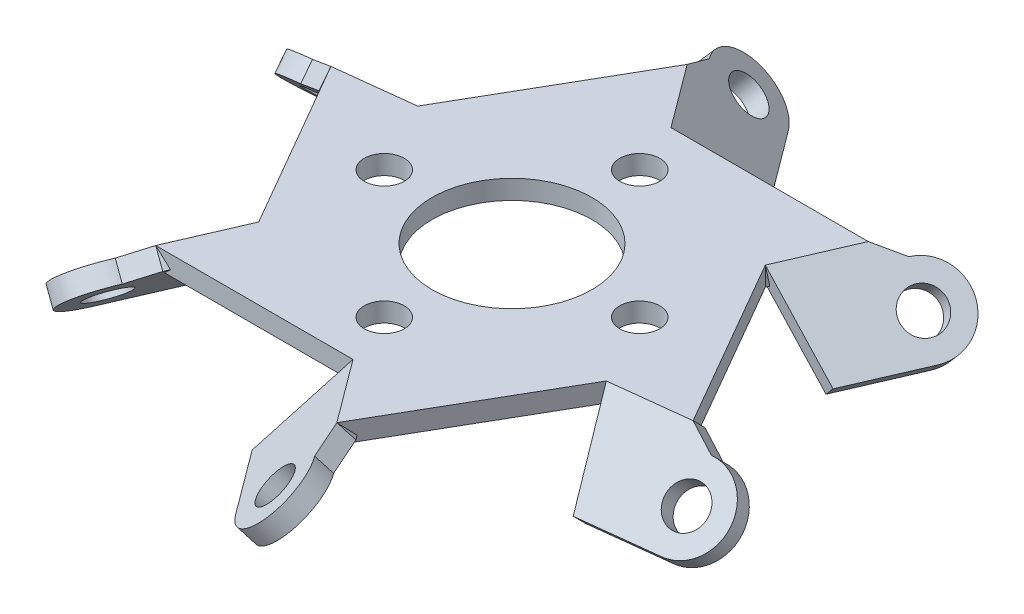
ISO-10303-21;
HEADER;
FILE_DESCRIPTION(('STEP AP214'),'2;1');
FILE_NAME('part.step','',(''),(''),'','','');
FILE_SCHEMA(('AUTOMOTIVE_DESIGN { 1 0 10303 214 1 1 1 1 }'));
ENDSEC;
DATA;
#1=APPLICATION_CONTEXT('core data for automotive mechanical design processes');
#2=APPLICATION_PROTOCOL_DEFINITION('international standard','automotive_design',2000,#1);
#3=PRODUCT_CONTEXT('',#1,'mechanical');
#4=PRODUCT('Part','Part','',(#3));
#5=PRODUCT_RELATED_PRODUCT_CATEGORY('part','',(#4));
#6=PRODUCT_DEFINITION_FORMATION('','',#4);
#7=PRODUCT_DEFINITION_CONTEXT('part definition',#1,'design');
#8=PRODUCT_DEFINITION('design','',#6,#7);
#9=PRODUCT_DEFINITION_SHAPE('','',#8);
#10=(LENGTH_UNIT() NAMED_UNIT(*) SI_UNIT(.MILLI.,.METRE.));
#11=(NAMED_UNIT(*) PLANE_ANGLE_UNIT() SI_UNIT($,.RADIAN.));
#12=(NAMED_UNIT(*) SI_UNIT($,.STERADIAN.) SOLID_ANGLE_UNIT());
#13=UNCERTAINTY_MEASURE_WITH_UNIT(LENGTH_MEASURE(1.E-05),#10,'distance_accuracy_value','');
#14=(GEOMETRIC_REPRESENTATION_CONTEXT(3) GLOBAL_UNCERTAINTY_ASSIGNED_CONTEXT((#13)) GLOBAL_UNIT_ASSIGNED_CONTEXT((#10,
#11,#12)) REPRESENTATION_CONTEXT('',''));
#15=CARTESIAN_POINT('',(0.,0.,0.));
#16=DIRECTION('',(0.,0.,1.));
#17=DIRECTION('',(1.,0.,0.));
#18=AXIS2_PLACEMENT_3D('',#15,#16,#17);
#19=CARTESIAN_POINT('',(18.4251395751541,-2.22169797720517,6.70494048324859));
#20=DIRECTION('',(0.0812752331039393,0.707106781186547,0.70242034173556));
#21=DIRECTION('',(0.,-0.704751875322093,0.709453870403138));
#22=AXIS2_PLACEMENT_3D('',#19,#20,#21);
#23=PLANE('',#22);
#24=DIRECTION('',(-0.993372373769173,0.,0.114940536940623));
#25=VECTOR('',#24,1.);
#26=CARTESIAN_POINT('',(19.2570466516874,0.4463692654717,3.92281450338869));
#27=LINE('',#26,#25);
#28=CARTESIAN_POINT('',(19.2570466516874,0.4463692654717,3.92281450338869));
#29=VERTEX_POINT('',#28);
#30=CARTESIAN_POINT('',(18.7935830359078,0.446369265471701,3.97644067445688));
#31=VERTEX_POINT('',#30);
#32=EDGE_CURVE('E300',#29,#31,#27,.T.);
#33=ORIENTED_EDGE('',*,*,#32,.F.);
#34=DIRECTION('',(-0.876695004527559,0.385972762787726,-0.287107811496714));
#35=VECTOR('',#34,1.);
#36=CARTESIAN_POINT('',(21.4209027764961,-0.506287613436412,4.63145318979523));
#37=LINE('',#36,#35);
#38=CARTESIAN_POINT('',(21.4209027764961,-0.506287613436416,4.63145318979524));
#39=VERTEX_POINT('',#38);
#40=EDGE_CURVE('E297',#39,#29,#37,.T.);
#41=ORIENTED_EDGE('',*,*,#40,.F.);
#42=CARTESIAN_POINT('',(21.6789516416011,-2.75135164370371,6.86163777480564));
#43=DIRECTION('',(-0.0812752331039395,-0.707106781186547,-0.70242034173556));
#44=DIRECTION('',(0.,0.704751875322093,-0.709453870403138));
#45=AXIS2_PLACEMENT_3D('',#42,#43,#44);
#46=CIRCLE('',#45,3.175);
#47=CARTESIAN_POINT('',(21.9370005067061,-4.99641567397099,9.09182235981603));
#48=VERTEX_POINT('',#47);
#49=EDGE_CURVE('E287',#48,#39,#46,.F.);
#50=ORIENTED_EDGE('',*,*,#49,.F.);
#51=DIRECTION('',(0.993372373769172,0.,-0.114940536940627));
#52=VECTOR('',#51,1.);
#53=CARTESIAN_POINT('',(15.6290859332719,-4.99641567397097,9.821694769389));
#54=LINE('',#53,#52);
#55=CARTESIAN_POINT('',(15.6290859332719,-4.99641567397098,9.821694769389));
#56=VERTEX_POINT('',#55);
#57=EDGE_CURVE('E282',#56,#48,#54,.T.);
#58=ORIENTED_EDGE('',*,*,#57,.F.);
#59=DIRECTION('',(0.321362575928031,-0.685705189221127,0.653096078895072));
#60=VECTOR('',#59,1.);
#61=CARTESIAN_POINT('',(13.2874658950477,0.,5.06288655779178));
#62=LINE('',#61,#60);
#63=CARTESIAN_POINT('',(13.2874658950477,0.,5.06288655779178));
#64=VERTEX_POINT('',#63);
#65=EDGE_CURVE('E317',#64,#56,#62,.T.);
#66=ORIENTED_EDGE('',*,*,#65,.F.);
#67=DIRECTION('',(0.993372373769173,0.,-0.114940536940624));
#68=VECTOR('',#67,1.);
#69=CARTESIAN_POINT('',(13.2874658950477,0.,5.06288655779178));
#70=LINE('',#69,#68);
#71=CARTESIAN_POINT('',(19.0367681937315,0.,4.39764972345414));
#72=VERTEX_POINT('',#71);
#73=EDGE_CURVE('E446',#64,#72,#70,.T.);
#74=ORIENTED_EDGE('',*,*,#73,.T.);
#75=DIRECTION('',(0.368377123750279,-0.676160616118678,0.63804789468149));
#76=VECTOR('',#75,1.);
#77=CARTESIAN_POINT('',(18.7935830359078,0.446369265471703,3.97644067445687));
#78=LINE('',#77,#76);
#79=EDGE_CURVE('E425',#31,#72,#78,.T.);
#80=ORIENTED_EDGE('',*,*,#79,.F.);
#81=EDGE_LOOP('',(#33,#41,#50,#58,#66,#74,#80));
#82=FACE_BOUND('',#81,.T.);
#83=CARTESIAN_POINT('',(21.6789516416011,-2.75135164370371,6.86163777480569));
#84=DIRECTION('',(0.0812752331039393,0.707106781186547,0.70242034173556));
#85=DIRECTION('',(0.,-0.704751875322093,0.709453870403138));
#86=AXIS2_PLACEMENT_3D('',#83,#84,#85);
#87=CIRCLE('',#86,1.5875);
#88=CARTESIAN_POINT('',(21.6789516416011,-3.87014524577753,7.98789579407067));
#89=VERTEX_POINT('',#88);
#90=EDGE_CURVE('E20',#89,#89,#87,.T.);
#91=ORIENTED_EDGE('',*,*,#90,.T.);
#92=EDGE_LOOP('',(#91));
#93=FACE_BOUND('',#92,.T.);
#94=ADVANCED_FACE('F17',(#82,#93),#23,.F.);
#95=CARTESIAN_POINT('',(15.019218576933,-2.22169797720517,-12.6041686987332));
#96=DIRECTION('',(0.648951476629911,0.707106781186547,0.280823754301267));
#97=DIRECTION('',(-0.736754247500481,0.676160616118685,0.));
#98=AXIS2_PLACEMENT_3D('',#95,#96,#97);
#99=PLANE('',#98);
#100=DIRECTION('',(-0.397144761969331,0.,0.917755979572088));
#101=VECTOR('',#100,1.);
#102=CARTESIAN_POINT('',(13.0257803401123,0.446369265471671,-14.715684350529));
#103=LINE('',#102,#101);
#104=CARTESIAN_POINT('',(13.0257803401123,0.446369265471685,-14.715684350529));
#105=VERTEX_POINT('',#104);
#106=CARTESIAN_POINT('',(12.8404901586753,0.446369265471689,-14.2875));
#107=VERTEX_POINT('',#106);
#108=EDGE_CURVE('E614',#105,#107,#103,.T.);
#109=ORIENTED_EDGE('',*,*,#108,.F.);
#110=DIRECTION('',(-0.686990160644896,0.385972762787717,0.61568623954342));
#111=VECTOR('',#110,1.);
#112=CARTESIAN_POINT('',(14.7214075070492,-0.506287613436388,-16.2353193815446));
#113=LINE('',#112,#111);
#114=CARTESIAN_POINT('',(14.7214075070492,-0.506287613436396,-16.2353193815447));
#115=VERTEX_POINT('',#114);
#116=EDGE_CURVE('E488',#115,#105,#113,.T.);
#117=ORIENTED_EDGE('',*,*,#116,.F.);
#118=CARTESIAN_POINT('',(16.7818284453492,-2.7513516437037,-15.3437039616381));
#119=DIRECTION('',(-0.648951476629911,-0.707106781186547,-0.280823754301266));
#120=DIRECTION('',(0.736754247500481,-0.676160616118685,0.));
#121=AXIS2_PLACEMENT_3D('',#118,#119,#120);
#122=CIRCLE('',#121,3.175);
#123=CARTESIAN_POINT('',(18.8422493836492,-4.99641567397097,-14.4520885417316));
#124=VERTEX_POINT('',#123);
#125=EDGE_CURVE('E615',#124,#115,#122,.F.);
#126=ORIENTED_EDGE('',*,*,#125,.F.);
#127=DIRECTION('',(0.397144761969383,0.,-0.917755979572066));
#128=VECTOR('',#127,1.);
#129=CARTESIAN_POINT('',(16.3203801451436,-4.99641567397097,-8.62433807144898));
#130=LINE('',#129,#128);
#131=CARTESIAN_POINT('',(16.3203801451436,-4.99641567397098,-8.62433807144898));
#132=VERTEX_POINT('',#131);
#133=EDGE_CURVE('E494',#132,#124,#130,.T.);
#134=ORIENTED_EDGE('',*,*,#133,.F.);
#135=DIRECTION('',(0.726279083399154,-0.685705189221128,0.0482398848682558));
#136=VECTOR('',#135,1.);
#137=CARTESIAN_POINT('',(11.0283213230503,0.,-8.97583973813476));
#138=LINE('',#137,#136);
#139=CARTESIAN_POINT('',(11.0283213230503,0.,-8.97583973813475));
#140=VERTEX_POINT('',#139);
#141=EDGE_CURVE('E435',#140,#132,#138,.T.);
#142=ORIENTED_EDGE('',*,*,#141,.F.);
#143=DIRECTION('',(0.397144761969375,0.,-0.917755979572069));
#144=VECTOR('',#143,1.);
#145=CARTESIAN_POINT('',(11.0283213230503,0.,-8.97583973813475));
#146=LINE('',#145,#144);
#147=CARTESIAN_POINT('',(13.3268604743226,0.,-14.2875));
#148=VERTEX_POINT('',#147);
#149=EDGE_CURVE('E431',#140,#148,#146,.T.);
#150=ORIENTED_EDGE('',*,*,#149,.T.);
#151=DIRECTION('',(-0.736754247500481,0.676160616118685,0.));
#152=VECTOR('',#151,1.);
#153=CARTESIAN_POINT('',(15.3522544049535,-1.85881739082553,-14.2875));
#154=LINE('',#153,#152);
#155=EDGE_CURVE('E408',#107,#148,#154,.F.);
#156=ORIENTED_EDGE('',*,*,#155,.F.);
#157=EDGE_LOOP('',(#109,#117,#126,#134,#142,#150,#156));
#158=FACE_BOUND('',#157,.T.);
#159=CARTESIAN_POINT('',(16.7818284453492,-2.75135164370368,-15.3437039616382));
#160=DIRECTION('',(0.648951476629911,0.707106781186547,0.280823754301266));
#161=DIRECTION('',(-0.736754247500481,0.676160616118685,0.));
#162=AXIS2_PLACEMENT_3D('',#159,#160,#161);
#163=CIRCLE('',#162,1.5875);
#164=CARTESIAN_POINT('',(15.6122310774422,-1.67794666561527,-15.3437039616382));
#165=VERTEX_POINT('',#164);
#166=EDGE_CURVE('E617',#165,#165,#163,.T.);
#167=ORIENTED_EDGE('',*,*,#166,.T.);
#168=EDGE_LOOP('',(#167));
#169=FACE_BOUND('',#168,.T.);
#170=ADVANCED_FACE('F1643',(#158,#169),#99,.F.);
#171=CARTESIAN_POINT('',(-3.40592099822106,-2.22169797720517,-19.3091091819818));
#172=DIRECTION('',(0.567676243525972,0.707106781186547,-0.421596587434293));
#173=DIRECTION('',(-0.779796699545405,0.626032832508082,0.));
#174=AXIS2_PLACEMENT_3D('',#171,#172,#173);
#175=PLANE('',#174);
#176=DIRECTION('',(0.596227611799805,0.,0.802815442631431));
#177=VECTOR('',#176,1.);
#178=CARTESIAN_POINT('',(-6.23126631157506,0.446369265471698,-18.6384988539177));
#179=LINE('',#178,#177);
#180=CARTESIAN_POINT('',(-6.23126631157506,0.4463692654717,-18.6384988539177));
#181=VERTEX_POINT('',#180);
#182=CARTESIAN_POINT('',(-5.95309287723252,0.446369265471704,-18.2639406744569));
#183=VERTEX_POINT('',#182);
#184=EDGE_CURVE('E608',#181,#183,#179,.T.);
#185=ORIENTED_EDGE('',*,*,#184,.F.);
#186=DIRECTION('',(0.18970484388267,0.385972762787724,0.902794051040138));
#187=VECTOR('',#186,1.);
#188=CARTESIAN_POINT('',(-6.69949526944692,-0.506287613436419,-20.8667725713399));
#189=LINE('',#188,#187);
#190=CARTESIAN_POINT('',(-6.69949526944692,-0.506287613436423,-20.8667725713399));
#191=VERTEX_POINT('',#190);
#192=EDGE_CURVE('E477',#191,#181,#189,.T.);
#193=ORIENTED_EDGE('',*,*,#192,.F.);
#194=CARTESIAN_POINT('',(-4.89712319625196,-2.75135164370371,-22.2053417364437));
#195=DIRECTION('',(-0.567676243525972,-0.707106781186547,0.421596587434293));
#196=DIRECTION('',(0.779796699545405,-0.626032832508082,0.));
#197=AXIS2_PLACEMENT_3D('',#194,#195,#196);
#198=CIRCLE('',#197,3.175);
#199=CARTESIAN_POINT('',(-3.094751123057,-4.99641567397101,-23.5439109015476));
#200=VERTEX_POINT('',#199);
#201=EDGE_CURVE('E609',#200,#191,#198,.F.);
#202=ORIENTED_EDGE('',*,*,#201,.F.);
#203=DIRECTION('',(-0.596227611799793,0.,-0.80281544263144));
#204=VECTOR('',#203,1.);
#205=CARTESIAN_POINT('',(0.69129421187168,-4.99641567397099,-18.446032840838));
#206=LINE('',#205,#204);
#207=CARTESIAN_POINT('',(0.691294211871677,-4.996415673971,-18.446032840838));
#208=VERTEX_POINT('',#207);
#209=EDGE_CURVE('E483',#208,#200,#206,.T.);
#210=ORIENTED_EDGE('',*,*,#209,.F.);
#211=DIRECTION('',(0.404916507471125,-0.685705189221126,-0.604856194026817));
#212=VECTOR('',#211,1.);
#213=CARTESIAN_POINT('',(-2.25914457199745,0.,-14.0387262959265));
#214=LINE('',#213,#212);
#215=CARTESIAN_POINT('',(-2.25914457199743,0.,-14.0387262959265));
#216=VERTEX_POINT('',#215);
#217=EDGE_CURVE('E418',#216,#208,#214,.T.);
#218=ORIENTED_EDGE('',*,*,#217,.F.);
#219=DIRECTION('',(-0.59622761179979,0.,-0.802815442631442));
#220=VECTOR('',#219,1.);
#221=CARTESIAN_POINT('',(-2.25914457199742,0.,-14.0387262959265));
#222=LINE('',#221,#220);
#223=CARTESIAN_POINT('',(-5.70990771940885,0.,-18.6851497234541));
#224=VERTEX_POINT('',#223);
#225=EDGE_CURVE('E414',#216,#224,#222,.T.);
#226=ORIENTED_EDGE('',*,*,#225,.T.);
#227=DIRECTION('',(0.368377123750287,-0.676160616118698,-0.638047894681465));
#228=VECTOR('',#227,1.);
#229=CARTESIAN_POINT('',(-5.95309287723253,0.446369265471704,-18.2639406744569));
#230=LINE('',#229,#228);
#231=EDGE_CURVE('E391',#183,#224,#230,.T.);
#232=ORIENTED_EDGE('',*,*,#231,.F.);
#233=EDGE_LOOP('',(#185,#193,#202,#210,#218,#226,#232));
#234=FACE_BOUND('',#233,.T.);
#235=CARTESIAN_POINT('',(-4.89712319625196,-2.75135164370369,-22.2053417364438));
#236=DIRECTION('',(0.567676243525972,0.707106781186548,-0.421596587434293));
#237=DIRECTION('',(-0.779796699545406,0.626032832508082,0.));
#238=AXIS2_PLACEMENT_3D('',#235,#236,#237);
#239=CIRCLE('',#238,1.5875);
#240=CARTESIAN_POINT('',(-6.13505045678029,-1.75752452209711,-22.2053417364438));
#241=VERTEX_POINT('',#240);
#242=EDGE_CURVE('E611',#241,#241,#239,.T.);
#243=ORIENTED_EDGE('',*,*,#242,.T.);
#244=EDGE_LOOP('',(#243));
#245=FACE_BOUND('',#244,.T.);
#246=ADVANCED_FACE('F1634',(#234,#245),#175,.F.);
#247=CARTESIAN_POINT('',(-18.4251395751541,-2.22169797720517,-6.7049404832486));
#248=DIRECTION('',(-0.0812752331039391,0.707106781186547,-0.70242034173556));
#249=DIRECTION('',(0.,0.704751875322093,0.709453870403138));
#250=AXIS2_PLACEMENT_3D('',#247,#248,#249);
#251=PLANE('',#250);
#252=DIRECTION('',(0.993372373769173,0.,-0.114940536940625));
#253=VECTOR('',#252,1.);
#254=CARTESIAN_POINT('',(-19.2570466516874,0.446369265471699,-3.9228145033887));
#255=LINE('',#254,#253);
#256=CARTESIAN_POINT('',(-19.2570466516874,0.446369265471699,-3.9228145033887));
#257=VERTEX_POINT('',#256);
#258=CARTESIAN_POINT('',(-18.7935830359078,0.446369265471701,-3.97644067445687));
#259=VERTEX_POINT('',#258);
#260=EDGE_CURVE('E602',#257,#259,#255,.T.);
#261=ORIENTED_EDGE('',*,*,#260,.F.);
#262=DIRECTION('',(0.876695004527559,0.385972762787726,0.287107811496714));
#263=VECTOR('',#262,1.);
#264=CARTESIAN_POINT('',(-21.4209027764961,-0.506287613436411,-4.63145318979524));
#265=LINE('',#264,#263);
#266=CARTESIAN_POINT('',(-21.4209027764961,-0.506287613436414,-4.63145318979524));
#267=VERTEX_POINT('',#266);
#268=EDGE_CURVE('E466',#267,#257,#265,.T.);
#269=ORIENTED_EDGE('',*,*,#268,.F.);
#270=CARTESIAN_POINT('',(-21.6789516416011,-2.75135164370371,-6.86163777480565));
#271=DIRECTION('',(0.0812752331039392,-0.707106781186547,0.70242034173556));
#272=DIRECTION('',(0.,-0.704751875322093,-0.709453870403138));
#273=AXIS2_PLACEMENT_3D('',#270,#271,#272);
#274=CIRCLE('',#273,3.175);
#275=CARTESIAN_POINT('',(-21.9370005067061,-4.99641567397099,-9.09182235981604));
#276=VERTEX_POINT('',#275);
#277=EDGE_CURVE('E603',#276,#267,#274,.F.);
#278=ORIENTED_EDGE('',*,*,#277,.F.);
#279=DIRECTION('',(-0.993372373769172,0.,0.114940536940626));
#280=VECTOR('',#279,1.);
#281=CARTESIAN_POINT('',(-15.6290859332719,-4.99641567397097,-9.821694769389));
#282=LINE('',#281,#280);
#283=CARTESIAN_POINT('',(-15.6290859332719,-4.99641567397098,-9.821694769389));
#284=VERTEX_POINT('',#283);
#285=EDGE_CURVE('E472',#284,#276,#282,.T.);
#286=ORIENTED_EDGE('',*,*,#285,.F.);
#287=DIRECTION('',(-0.321362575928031,-0.685705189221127,-0.653096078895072));
#288=VECTOR('',#287,1.);
#289=CARTESIAN_POINT('',(-13.2874658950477,0.,-5.06288655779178));
#290=LINE('',#289,#288);
#291=CARTESIAN_POINT('',(-13.2874658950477,0.,-5.06288655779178));
#292=VERTEX_POINT('',#291);
#293=EDGE_CURVE('E401',#292,#284,#290,.T.);
#294=ORIENTED_EDGE('',*,*,#293,.F.);
#295=DIRECTION('',(-0.993372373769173,0.,0.114940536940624));
#296=VECTOR('',#295,1.);
#297=CARTESIAN_POINT('',(-13.2874658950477,0.,-5.06288655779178));
#298=LINE('',#297,#296);
#299=CARTESIAN_POINT('',(-19.0367681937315,0.,-4.39764972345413));
#300=VERTEX_POINT('',#299);
#301=EDGE_CURVE('E397',#292,#300,#298,.T.);
#302=ORIENTED_EDGE('',*,*,#301,.T.);
#303=DIRECTION('',(-0.368377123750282,-0.676160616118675,-0.638047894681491));
#304=VECTOR('',#303,1.);
#305=CARTESIAN_POINT('',(-18.7935830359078,0.446369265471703,-3.97644067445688));
#306=LINE('',#305,#304);
#307=EDGE_CURVE('E374',#259,#300,#306,.T.);
#308=ORIENTED_EDGE('',*,*,#307,.F.);
#309=EDGE_LOOP('',(#261,#269,#278,#286,#294,#302,#308));
#310=FACE_BOUND('',#309,.T.);
#311=CARTESIAN_POINT('',(-21.6789516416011,-2.75135164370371,-6.86163777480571));
#312=DIRECTION('',(-0.0812752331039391,0.707106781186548,-0.70242034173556));
#313=DIRECTION('',(0.,0.704751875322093,0.709453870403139));
#314=AXIS2_PLACEMENT_3D('',#311,#312,#313);
#315=CIRCLE('',#314,1.5875);
#316=CARTESIAN_POINT('',(-21.6789516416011,-1.63255804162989,-5.73537975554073));
#317=VERTEX_POINT('',#316);
#318=EDGE_CURVE('E605',#317,#317,#315,.T.);
#319=ORIENTED_EDGE('',*,*,#318,.T.);
#320=EDGE_LOOP('',(#319));
#321=FACE_BOUND('',#320,.T.);
#322=ADVANCED_FACE('F1626',(#310,#321),#251,.F.);
#323=CARTESIAN_POINT('',(-15.0192185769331,-2.22169797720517,12.6041686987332));
#324=DIRECTION('',(-0.648951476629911,0.707106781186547,-0.280823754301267));
#325=DIRECTION('',(-0.736754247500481,-0.676160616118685,0.));
#326=AXIS2_PLACEMENT_3D('',#323,#324,#325);
#327=PLANE('',#326);
#328=DIRECTION('',(0.397144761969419,0.,-0.91775597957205));
#329=VECTOR('',#328,1.);
#330=CARTESIAN_POINT('',(-13.0257803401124,0.446369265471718,14.715684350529));
#331=LINE('',#330,#329);
#332=CARTESIAN_POINT('',(-13.0257803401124,0.446369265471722,14.715684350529));
#333=VERTEX_POINT('',#332);
#334=CARTESIAN_POINT('',(-12.8404901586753,0.446369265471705,14.2875));
#335=VERTEX_POINT('',#334);
#336=EDGE_CURVE('E346',#333,#335,#331,.T.);
#337=ORIENTED_EDGE('',*,*,#336,.F.);
#338=DIRECTION('',(0.686990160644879,0.385972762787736,-0.615686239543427));
#339=VECTOR('',#338,1.);
#340=CARTESIAN_POINT('',(-14.7214075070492,-0.506287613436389,16.2353193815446));
#341=LINE('',#340,#339);
#342=CARTESIAN_POINT('',(-14.7214075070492,-0.50628761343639,16.2353193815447));
#343=VERTEX_POINT('',#342);
#344=EDGE_CURVE('E455',#343,#333,#341,.T.);
#345=ORIENTED_EDGE('',*,*,#344,.F.);
#346=CARTESIAN_POINT('',(-16.7818284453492,-2.7513516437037,15.3437039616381));
#347=DIRECTION('',(0.648951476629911,-0.707106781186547,0.280823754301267));
#348=DIRECTION('',(0.736754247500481,0.676160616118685,0.));
#349=AXIS2_PLACEMENT_3D('',#346,#347,#348);
#350=CIRCLE('',#349,3.175);
#351=CARTESIAN_POINT('',(-18.8422493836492,-4.99641567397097,14.4520885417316));
#352=VERTEX_POINT('',#351);
#353=EDGE_CURVE('E597',#352,#343,#350,.F.);
#354=ORIENTED_EDGE('',*,*,#353,.F.);
#355=DIRECTION('',(-0.397144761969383,0.,0.917755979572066));
#356=VECTOR('',#355,1.);
#357=CARTESIAN_POINT('',(-16.3203801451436,-4.99641567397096,8.62433807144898));
#358=LINE('',#357,#356);
#359=CARTESIAN_POINT('',(-16.3203801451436,-4.99641567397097,8.62433807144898));
#360=VERTEX_POINT('',#359);
#361=EDGE_CURVE('E461',#360,#352,#358,.T.);
#362=ORIENTED_EDGE('',*,*,#361,.F.);
#363=DIRECTION('',(-0.726279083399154,-0.685705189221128,-0.0482398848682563));
#364=VECTOR('',#363,1.);
#365=CARTESIAN_POINT('',(-11.0283213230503,0.,8.97583973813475));
#366=LINE('',#365,#364);
#367=CARTESIAN_POINT('',(-11.0283213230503,0.,8.97583973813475));
#368=VERTEX_POINT('',#367);
#369=EDGE_CURVE('E384',#368,#360,#366,.T.);
#370=ORIENTED_EDGE('',*,*,#369,.F.);
#371=DIRECTION('',(-0.397144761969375,0.,0.917755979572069));
#372=VECTOR('',#371,1.);
#373=CARTESIAN_POINT('',(-11.0283213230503,0.,8.97583973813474));
#374=LINE('',#373,#372);
#375=CARTESIAN_POINT('',(-13.3268604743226,0.,14.2875));
#376=VERTEX_POINT('',#375);
#377=EDGE_CURVE('E380',#368,#376,#374,.T.);
#378=ORIENTED_EDGE('',*,*,#377,.T.);
#379=DIRECTION('',(-0.736754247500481,-0.676160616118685,0.));
#380=VECTOR('',#379,1.);
#381=CARTESIAN_POINT('',(-15.3522544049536,-1.85881739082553,14.2875));
#382=LINE('',#381,#380);
#383=EDGE_CURVE('E372',#335,#376,#382,.T.);
#384=ORIENTED_EDGE('',*,*,#383,.F.);
#385=EDGE_LOOP('',(#337,#345,#354,#362,#370,#378,#384));
#386=FACE_BOUND('',#385,.T.);
#387=CARTESIAN_POINT('',(-16.7818284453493,-2.75135164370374,15.3437039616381));
#388=DIRECTION('',(-0.648951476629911,0.707106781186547,-0.280823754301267));
#389=DIRECTION('',(-0.736754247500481,-0.676160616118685,0.));
#390=AXIS2_PLACEMENT_3D('',#387,#388,#389);
#391=CIRCLE('',#390,1.5875);
#392=CARTESIAN_POINT('',(-17.9514258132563,-3.82475662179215,15.3437039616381));
#393=VERTEX_POINT('',#392);
#394=EDGE_CURVE('E599',#393,#393,#391,.T.);
#395=ORIENTED_EDGE('',*,*,#394,.T.);
#396=EDGE_LOOP('',(#395));
#397=FACE_BOUND('',#396,.T.);
#398=ADVANCED_FACE('F1068',(#386,#397),#327,.F.);
#399=CARTESIAN_POINT('',(3.40592099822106,-2.22169797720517,19.3091091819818));
#400=DIRECTION('',(-0.567676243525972,0.707106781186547,0.421596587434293));
#401=DIRECTION('',(-0.779796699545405,-0.626032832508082,0.));
#402=AXIS2_PLACEMENT_3D('',#399,#400,#401);
#403=PLANE('',#402);
#404=DIRECTION('',(-0.36837712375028,-0.676160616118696,0.63804789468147));
#405=VECTOR('',#404,1.);
#406=CARTESIAN_POINT('',(5.95309287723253,0.446369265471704,18.2639406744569));
#407=LINE('',#406,#405);
#408=CARTESIAN_POINT('',(5.95309287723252,0.446369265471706,18.2639406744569));
#409=VERTEX_POINT('',#408);
#410=CARTESIAN_POINT('',(5.70990771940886,0.,18.6851497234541));
#411=VERTEX_POINT('',#410);
#412=EDGE_CURVE('E328',#409,#411,#407,.T.);
#413=ORIENTED_EDGE('',*,*,#412,.F.);
#414=DIRECTION('',(-0.596227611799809,0.,-0.802815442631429));
#415=VECTOR('',#414,1.);
#416=CARTESIAN_POINT('',(6.23126631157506,0.446369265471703,18.6384988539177));
#417=LINE('',#416,#415);
#418=CARTESIAN_POINT('',(6.23126631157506,0.446369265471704,18.6384988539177));
#419=VERTEX_POINT('',#418);
#420=EDGE_CURVE('E325',#419,#409,#417,.T.);
#421=ORIENTED_EDGE('',*,*,#420,.F.);
#422=DIRECTION('',(-0.18970484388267,0.385972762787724,-0.902794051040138));
#423=VECTOR('',#422,1.);
#424=CARTESIAN_POINT('',(6.69949526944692,-0.506287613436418,20.8667725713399));
#425=LINE('',#424,#423);
#426=CARTESIAN_POINT('',(6.69949526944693,-0.506287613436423,20.8667725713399));
#427=VERTEX_POINT('',#426);
#428=EDGE_CURVE('E349',#427,#419,#425,.T.);
#429=ORIENTED_EDGE('',*,*,#428,.F.);
#430=CARTESIAN_POINT('',(4.89712319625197,-2.75135164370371,22.2053417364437));
#431=DIRECTION('',(0.567676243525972,-0.707106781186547,-0.421596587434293));
#432=DIRECTION('',(0.779796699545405,0.626032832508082,0.));
#433=AXIS2_PLACEMENT_3D('',#430,#431,#432);
#434=CIRCLE('',#433,3.175);
#435=CARTESIAN_POINT('',(3.09475112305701,-4.99641567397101,23.5439109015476));
#436=VERTEX_POINT('',#435);
#437=EDGE_CURVE('E592',#436,#427,#434,.F.);
#438=ORIENTED_EDGE('',*,*,#437,.F.);
#439=DIRECTION('',(0.596227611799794,0.,0.80281544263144));
#440=VECTOR('',#439,1.);
#441=CARTESIAN_POINT('',(-0.691294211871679,-4.996415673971,18.446032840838));
#442=LINE('',#441,#440);
#443=CARTESIAN_POINT('',(-0.691294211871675,-4.996415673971,18.446032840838));
#444=VERTEX_POINT('',#443);
#445=EDGE_CURVE('E356',#444,#436,#442,.T.);
#446=ORIENTED_EDGE('',*,*,#445,.F.);
#447=DIRECTION('',(-0.404916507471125,-0.685705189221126,0.604856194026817));
#448=VECTOR('',#447,1.);
#449=CARTESIAN_POINT('',(2.25914457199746,0.,14.0387262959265));
#450=LINE('',#449,#448);
#451=CARTESIAN_POINT('',(2.25914457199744,0.,14.0387262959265));
#452=VERTEX_POINT('',#451);
#453=EDGE_CURVE('E362',#452,#444,#450,.T.);
#454=ORIENTED_EDGE('',*,*,#453,.F.);
#455=DIRECTION('',(0.596227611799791,0.,0.802815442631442));
#456=VECTOR('',#455,1.);
#457=CARTESIAN_POINT('',(2.25914457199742,0.,14.0387262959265));
#458=LINE('',#457,#456);
#459=EDGE_CURVE('E341',#452,#411,#458,.T.);
#460=ORIENTED_EDGE('',*,*,#459,.T.);
#461=EDGE_LOOP('',(#413,#421,#429,#438,#446,#454,#460));
#462=FACE_BOUND('',#461,.T.);
#463=CARTESIAN_POINT('',(4.89712319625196,-2.75135164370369,22.2053417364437));
#464=DIRECTION('',(-0.567676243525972,0.707106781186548,0.421596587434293));
#465=DIRECTION('',(-0.779796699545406,-0.626032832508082,0.));
#466=AXIS2_PLACEMENT_3D('',#463,#464,#465);
#467=CIRCLE('',#466,1.5875);
#468=CARTESIAN_POINT('',(3.65919593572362,-3.74517876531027,22.2053417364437));
#469=VERTEX_POINT('',#468);
#470=EDGE_CURVE('E369',#469,#469,#467,.T.);
#471=ORIENTED_EDGE('',*,*,#470,.T.);
#472=EDGE_LOOP('',(#471));
#473=FACE_BOUND('',#472,.T.);
#474=ADVANCED_FACE('F994',(#462,#473),#403,.F.);
#475=CARTESIAN_POINT('',(19.3806839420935,1.524,4.99332927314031));
#476=DIRECTION('',(0.114940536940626,0.,0.993372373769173));
#477=DIRECTION('',(0.993372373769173,0.,-0.114940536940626));
#478=AXIS2_PLACEMENT_3D('',#475,#476,#477);
#479=PLANE('',#478);
#480=DIRECTION('',(0.,1.,0.));
#481=VECTOR('',#480,1.);
#482=CARTESIAN_POINT('',(13.2021339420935,0.,5.70823324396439));
#483=LINE('',#482,#481);
#484=CARTESIAN_POINT('',(13.2021339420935,0.,5.70823324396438));
#485=VERTEX_POINT('',#484);
#486=CARTESIAN_POINT('',(13.2021339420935,1.524,5.70823324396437));
#487=VERTEX_POINT('',#486);
#488=EDGE_CURVE('E334',#485,#487,#483,.T.);
#489=ORIENTED_EDGE('',*,*,#488,.F.);
#490=DIRECTION('',(0.993372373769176,0.,-0.114940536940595));
#491=VECTOR('',#490,1.);
#492=CARTESIAN_POINT('',(13.2021339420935,0.,5.70823324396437));
#493=LINE('',#492,#491);
#494=CARTESIAN_POINT('',(13.4716681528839,0.,5.67704614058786));
#495=VERTEX_POINT('',#494);
#496=EDGE_CURVE('E338',#485,#495,#493,.T.);
#497=ORIENTED_EDGE('',*,*,#496,.T.);
#498=DIRECTION('',(0.174121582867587,-0.98451803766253,-0.0201471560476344));
#499=VECTOR('',#498,1.);
#500=CARTESIAN_POINT('',(13.2021339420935,1.52400000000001,5.70823324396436));
#501=LINE('',#500,#499);
#502=EDGE_CURVE('E320',#487,#495,#501,.T.);
#503=ORIENTED_EDGE('',*,*,#502,.F.);
#504=EDGE_LOOP('',(#489,#497,#503));
#505=FACE_BOUND('',#504,.T.);
#506=ADVANCED_FACE('F1604',(#505),#479,.T.);
#507=CARTESIAN_POINT('',(1.65759197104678,1.524,14.2875));
#508=DIRECTION('',(0.567676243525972,0.707106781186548,-0.421596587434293));
#509=DIRECTION('',(-0.779796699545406,0.626032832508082,0.));
#510=AXIS2_PLACEMENT_3D('',#507,#508,#509);
#511=PLANE('',#510);
#512=DIRECTION('',(-0.567676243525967,0.707106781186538,0.421596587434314));
#513=VECTOR('',#512,1.);
#514=CARTESIAN_POINT('',(6.23126631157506,0.446369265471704,18.6384988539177));
#515=LINE('',#514,#513);
#516=CARTESIAN_POINT('',(5.36605984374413,1.524,19.2809206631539));
#517=VERTEX_POINT('',#516);
#518=EDGE_CURVE('E352',#419,#517,#515,.T.);
#519=ORIENTED_EDGE('',*,*,#518,.F.);
#520=ORIENTED_EDGE('',*,*,#420,.T.);
#521=DIRECTION('',(0.368377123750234,-0.676160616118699,-0.638047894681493));
#522=VECTOR('',#521,1.);
#523=CARTESIAN_POINT('',(5.36599197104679,1.524,19.2808292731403));
#524=LINE('',#523,#522);
#525=EDGE_CURVE('E577',#517,#409,#524,.T.);
#526=ORIENTED_EDGE('',*,*,#525,.F.);
#527=EDGE_LOOP('',(#519,#520,#526));
#528=FACE_BOUND('',#527,.T.);
#529=ADVANCED_FACE('F997',(#528),#511,.T.);
#530=CARTESIAN_POINT('',(15.9512950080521,-52.5828278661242,-42.6395740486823));
#531=DIRECTION('',(0.0812752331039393,0.707106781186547,0.70242034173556));
#532=DIRECTION('',(0.,-0.704751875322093,0.709453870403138));
#533=AXIS2_PLACEMENT_3D('',#530,#531,#532);
#534=CYLINDRICAL_SURFACE('',#533,1.5875);
#535=CARTESIAN_POINT('',(21.8028150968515,-1.67372090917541,7.93212637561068));
#536=DIRECTION('',(0.0812752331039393,0.707106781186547,0.70242034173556));
#537=DIRECTION('',(0.,-0.704751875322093,0.709453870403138));
#538=AXIS2_PLACEMENT_3D('',#535,#536,#537);
#539=CIRCLE('',#538,1.5875);
#540=CARTESIAN_POINT('',(21.8028150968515,-2.79251451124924,9.05838439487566));
#541=VERTEX_POINT('',#540);
#542=EDGE_CURVE('E573',#541,#541,#539,.F.);
#543=ORIENTED_EDGE('',*,*,#542,.F.);
#544=EDGE_LOOP('',(#543));
#545=FACE_BOUND('',#544,.T.);
#546=ORIENTED_EDGE('',*,*,#90,.F.);
#547=EDGE_LOOP('',(#546));
#548=FACE_BOUND('',#547,.T.);
#549=ADVANCED_FACE('F1587',(#545,#548),#534,.F.);
#550=CARTESIAN_POINT('',(15.7529493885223,-3.9187849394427,10.892183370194));
#551=DIRECTION('',(-0.943461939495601,-0.172651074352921,0.282968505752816));
#552=DIRECTION('',(0.287282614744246,0.,0.957845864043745));
#553=AXIS2_PLACEMENT_3D('',#550,#551,#552);
#554=PLANE('',#553);
#555=DIRECTION('',(-0.0812752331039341,-0.707106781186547,-0.70242034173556));
#556=VECTOR('',#555,1.);
#557=CARTESIAN_POINT('',(15.7529493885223,-3.91878493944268,10.892183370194));
#558=LINE('',#557,#556);
#559=CARTESIAN_POINT('',(15.7529493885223,-3.91878493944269,10.892183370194));
#560=VERTEX_POINT('',#559);
#561=EDGE_CURVE('E315',#560,#56,#558,.T.);
#562=ORIENTED_EDGE('',*,*,#561,.F.);
#563=DIRECTION('',(0.321362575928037,-0.685705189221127,0.65309607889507));
#564=VECTOR('',#563,1.);
#565=CARTESIAN_POINT('',(13.2021339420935,1.52400000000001,5.70823324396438));
#566=LINE('',#565,#564);
#567=EDGE_CURVE('E576',#487,#560,#566,.T.);
#568=ORIENTED_EDGE('',*,*,#567,.F.);
#569=ORIENTED_EDGE('',*,*,#502,.T.);
#570=DIRECTION('',(-0.287282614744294,0.,-0.957845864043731));
#571=VECTOR('',#570,1.);
#572=CARTESIAN_POINT('',(13.4716681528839,0.,5.67704614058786));
#573=LINE('',#572,#571);
#574=EDGE_CURVE('E340',#495,#64,#573,.T.);
#575=ORIENTED_EDGE('',*,*,#574,.T.);
#576=ORIENTED_EDGE('',*,*,#65,.T.);
#577=EDGE_LOOP('',(#562,#568,#569,#575,#576));
#578=FACE_BOUND('',#577,.T.);
#579=ADVANCED_FACE('F1579',(#578),#554,.T.);
#580=CARTESIAN_POINT('',(22.0608639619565,-3.9187849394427,10.162310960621));
#581=DIRECTION('',(0.0812752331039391,-0.707106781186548,0.70242034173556));
#582=DIRECTION('',(0.,-0.704751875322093,-0.709453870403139));
#583=AXIS2_PLACEMENT_3D('',#580,#581,#582);
#584=PLANE('',#583);
#585=ORIENTED_EDGE('',*,*,#57,.T.);
#586=DIRECTION('',(-0.0812752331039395,-0.707106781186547,-0.70242034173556));
#587=VECTOR('',#586,1.);
#588=CARTESIAN_POINT('',(22.0608639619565,-3.9187849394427,10.162310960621));
#589=LINE('',#588,#587);
#590=CARTESIAN_POINT('',(22.0608639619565,-3.91878493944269,10.162310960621));
#591=VERTEX_POINT('',#590);
#592=EDGE_CURVE('E294',#591,#48,#589,.T.);
#593=ORIENTED_EDGE('',*,*,#592,.F.);
#594=DIRECTION('',(0.993372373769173,0.,-0.114940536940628));
#595=VECTOR('',#594,1.);
#596=CARTESIAN_POINT('',(15.7529493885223,-3.91878493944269,10.892183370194));
#597=LINE('',#596,#595);
#598=EDGE_CURVE('E572',#560,#591,#597,.T.);
#599=ORIENTED_EDGE('',*,*,#598,.F.);
#600=ORIENTED_EDGE('',*,*,#561,.T.);
#601=EDGE_LOOP('',(#585,#593,#599,#600));
#602=FACE_BOUND('',#601,.T.);
#603=ADVANCED_FACE('F1571',(#602),#584,.T.);
#604=CARTESIAN_POINT('',(21.8028150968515,-1.67372090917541,7.93212637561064));
#605=DIRECTION('',(-0.0812752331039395,-0.707106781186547,-0.70242034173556));
#606=DIRECTION('',(0.,0.704751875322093,-0.709453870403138));
#607=AXIS2_PLACEMENT_3D('',#604,#605,#606);
#608=CYLINDRICAL_SURFACE('',#607,3.175);
#609=ORIENTED_EDGE('',*,*,#49,.T.);
#610=DIRECTION('',(-0.0812752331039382,-0.707106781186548,-0.702420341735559));
#611=VECTOR('',#610,1.);
#612=CARTESIAN_POINT('',(21.5447662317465,0.571343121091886,5.70194179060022));
#613=LINE('',#612,#611);
#614=CARTESIAN_POINT('',(21.5447662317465,0.571343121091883,5.70194179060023));
#615=VERTEX_POINT('',#614);
#616=EDGE_CURVE('E292',#615,#39,#613,.T.);
#617=ORIENTED_EDGE('',*,*,#616,.F.);
#618=CARTESIAN_POINT('',(21.8028150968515,-1.67372090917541,7.93212637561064));
#619=DIRECTION('',(-0.0812752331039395,-0.707106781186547,-0.70242034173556));
#620=DIRECTION('',(0.,0.704751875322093,-0.709453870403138));
#621=AXIS2_PLACEMENT_3D('',#618,#619,#620);
#622=CIRCLE('',#621,3.175);
#623=EDGE_CURVE('E570',#591,#615,#622,.F.);
#624=ORIENTED_EDGE('',*,*,#623,.F.);
#625=ORIENTED_EDGE('',*,*,#592,.T.);
#626=EDGE_LOOP('',(#609,#617,#624,#625));
#627=FACE_BOUND('',#626,.T.);
#628=ADVANCED_FACE('F289',(#627),#608,.T.);
#629=CARTESIAN_POINT('',(19.3809101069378,1.524,4.99330310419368));
#630=DIRECTION('',(0.474131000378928,0.592473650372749,-0.651287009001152));
#631=DIRECTION('',(0.,0.739716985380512,0.672918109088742));
#632=AXIS2_PLACEMENT_3D('',#629,#630,#631);
#633=PLANE('',#632);
#634=ORIENTED_EDGE('',*,*,#40,.T.);
#635=DIRECTION('',(-0.081275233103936,-0.707106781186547,-0.70242034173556));
#636=VECTOR('',#635,1.);
#637=CARTESIAN_POINT('',(19.3809101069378,1.524,4.99330310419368));
#638=LINE('',#637,#636);
#639=CARTESIAN_POINT('',(19.3807970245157,1.524,4.993316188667));
#640=VERTEX_POINT('',#639);
#641=EDGE_CURVE('E303',#640,#29,#638,.T.);
#642=ORIENTED_EDGE('',*,*,#641,.F.);
#643=DIRECTION('',(-0.876695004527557,0.385972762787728,-0.287107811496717));
#644=VECTOR('',#643,1.);
#645=CARTESIAN_POINT('',(21.5447662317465,0.571343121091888,5.70194179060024));
#646=LINE('',#645,#644);
#647=EDGE_CURVE('E307',#615,#640,#646,.T.);
#648=ORIENTED_EDGE('',*,*,#647,.F.);
#649=ORIENTED_EDGE('',*,*,#616,.T.);
#650=EDGE_LOOP('',(#634,#642,#648,#649));
#651=FACE_BOUND('',#650,.T.);
#652=ADVANCED_FACE('F305',(#651),#633,.T.);
#653=CARTESIAN_POINT('',(13.2021339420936,1.524,5.70823324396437));
#654=DIRECTION('',(-0.0812752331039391,0.707106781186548,-0.70242034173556));
#655=DIRECTION('',(0.,0.704751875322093,0.709453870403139));
#656=AXIS2_PLACEMENT_3D('',#653,#654,#655);
#657=PLANE('',#656);
#658=ORIENTED_EDGE('',*,*,#641,.T.);
#659=ORIENTED_EDGE('',*,*,#32,.T.);
#660=DIRECTION('',(-0.368377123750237,-0.676160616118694,-0.638047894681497));
#661=VECTOR('',#660,1.);
#662=CARTESIAN_POINT('',(19.3806839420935,1.524,4.99332927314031));
#663=LINE('',#662,#661);
#664=EDGE_CURVE('E642',#640,#31,#663,.T.);
#665=ORIENTED_EDGE('',*,*,#664,.F.);
#666=EDGE_LOOP('',(#658,#659,#665));
#667=FACE_BOUND('',#666,.T.);
#668=ADVANCED_FACE('F1549',(#667),#657,.T.);
#669=CARTESIAN_POINT('',(14.0146919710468,1.524,-14.2875));
#670=DIRECTION('',(0.917755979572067,0.,0.397144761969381));
#671=DIRECTION('',(0.397144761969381,0.,-0.917755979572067));
#672=AXIS2_PLACEMENT_3D('',#669,#670,#671);
#673=PLANE('',#672);
#674=DIRECTION('',(0.,1.,0.));
#675=VECTOR('',#674,1.);
#676=CARTESIAN_POINT('',(11.5445419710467,0.,-8.57926675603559));
#677=LINE('',#676,#675);
#678=CARTESIAN_POINT('',(11.5445419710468,0.,-8.5792667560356));
#679=VERTEX_POINT('',#678);
#680=CARTESIAN_POINT('',(11.5445419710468,1.524,-8.57926675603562));
#681=VERTEX_POINT('',#680);
#682=EDGE_CURVE('E569',#679,#681,#677,.T.);
#683=ORIENTED_EDGE('',*,*,#682,.F.);
#684=DIRECTION('',(0.397144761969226,0.,-0.917755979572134));
#685=VECTOR('',#684,1.);
#686=CARTESIAN_POINT('',(11.5445419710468,0.,-8.57926675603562));
#687=LINE('',#686,#685);
#688=CARTESIAN_POINT('',(11.6523002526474,0.,-8.82828378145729));
#689=VERTEX_POINT('',#688);
#690=EDGE_CURVE('E432',#679,#689,#687,.T.);
#691=ORIENTED_EDGE('',*,*,#690,.T.);
#692=DIRECTION('',(0.0696128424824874,-0.984518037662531,-0.160867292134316));
#693=VECTOR('',#692,1.);
#694=CARTESIAN_POINT('',(11.5445419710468,1.52400000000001,-8.57926675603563));
#695=LINE('',#694,#693);
#696=EDGE_CURVE('E438',#681,#689,#695,.T.);
#697=ORIENTED_EDGE('',*,*,#696,.F.);
#698=EDGE_LOOP('',(#683,#691,#697));
#699=FACE_BOUND('',#698,.T.);
#700=ADVANCED_FACE('F1540',(#699),#673,.T.);
#701=CARTESIAN_POINT('',(-28.9513068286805,-52.5828278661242,-35.1340137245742));
#702=DIRECTION('',(0.648951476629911,0.707106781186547,0.280823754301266));
#703=DIRECTION('',(-0.736754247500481,0.676160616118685,0.));
#704=AXIS2_PLACEMENT_3D('',#701,#702,#703);
#705=CYLINDRICAL_SURFACE('',#704,1.5875);
#706=CARTESIAN_POINT('',(17.7708304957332,-1.67372090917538,-14.915728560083));
#707=DIRECTION('',(0.648951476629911,0.707106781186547,0.280823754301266));
#708=DIRECTION('',(-0.736754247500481,0.676160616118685,0.));
#709=AXIS2_PLACEMENT_3D('',#706,#707,#708);
#710=CIRCLE('',#709,1.5875);
#711=CARTESIAN_POINT('',(16.6012331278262,-0.600315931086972,-14.915728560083));
#712=VERTEX_POINT('',#711);
#713=EDGE_CURVE('E565',#712,#712,#710,.F.);
#714=ORIENTED_EDGE('',*,*,#713,.F.);
#715=EDGE_LOOP('',(#714));
#716=FACE_BOUND('',#715,.T.);
#717=ORIENTED_EDGE('',*,*,#166,.F.);
#718=EDGE_LOOP('',(#717));
#719=FACE_BOUND('',#718,.T.);
#720=ADVANCED_FACE('F1531',(#716,#719),#705,.F.);
#721=CARTESIAN_POINT('',(17.3093821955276,-3.9187849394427,-8.19636266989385));
#722=DIRECTION('',(-0.226673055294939,-0.172651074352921,0.958546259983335));
#723=DIRECTION('',(0.973160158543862,0.,0.230128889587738));
#724=AXIS2_PLACEMENT_3D('',#721,#722,#723);
#725=PLANE('',#724);
#726=DIRECTION('',(-0.648951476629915,-0.707106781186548,-0.280823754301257));
#727=VECTOR('',#726,1.);
#728=CARTESIAN_POINT('',(17.3093821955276,-3.91878493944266,-8.19636266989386));
#729=LINE('',#728,#727);
#730=CARTESIAN_POINT('',(17.3093821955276,-3.91878493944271,-8.19636266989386));
#731=VERTEX_POINT('',#730);
#732=EDGE_CURVE('E437',#731,#132,#729,.T.);
#733=ORIENTED_EDGE('',*,*,#732,.F.);
#734=DIRECTION('',(0.726279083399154,-0.685705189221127,0.0482398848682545));
#735=VECTOR('',#734,1.);
#736=CARTESIAN_POINT('',(11.5445419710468,1.52399999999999,-8.57926675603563));
#737=LINE('',#736,#735);
#738=EDGE_CURVE('E568',#681,#731,#737,.T.);
#739=ORIENTED_EDGE('',*,*,#738,.F.);
#740=ORIENTED_EDGE('',*,*,#696,.T.);
#741=DIRECTION('',(-0.973160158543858,0.,-0.230128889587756));
#742=VECTOR('',#741,1.);
#743=CARTESIAN_POINT('',(11.6523002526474,0.,-8.82828378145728));
#744=LINE('',#743,#742);
#745=EDGE_CURVE('E428',#689,#140,#744,.T.);
#746=ORIENTED_EDGE('',*,*,#745,.T.);
#747=ORIENTED_EDGE('',*,*,#141,.T.);
#748=EDGE_LOOP('',(#733,#739,#740,#746,#747));
#749=FACE_BOUND('',#748,.T.);
#750=ADVANCED_FACE('F1522',(#749),#725,.T.);
#751=CARTESIAN_POINT('',(19.8312514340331,-3.9187849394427,-14.0241131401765));
#752=DIRECTION('',(0.648951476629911,-0.707106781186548,0.280823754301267));
#753=DIRECTION('',(0.736754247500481,0.676160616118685,0.));
#754=AXIS2_PLACEMENT_3D('',#751,#752,#753);
#755=PLANE('',#754);
#756=ORIENTED_EDGE('',*,*,#133,.T.);
#757=DIRECTION('',(-0.648951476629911,-0.707106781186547,-0.280823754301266));
#758=VECTOR('',#757,1.);
#759=CARTESIAN_POINT('',(19.8312514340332,-3.9187849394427,-14.0241131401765));
#760=LINE('',#759,#758);
#761=CARTESIAN_POINT('',(19.8312514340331,-3.91878493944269,-14.0241131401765));
#762=VERTEX_POINT('',#761);
#763=EDGE_CURVE('E496',#762,#124,#760,.T.);
#764=ORIENTED_EDGE('',*,*,#763,.F.);
#765=DIRECTION('',(0.397144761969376,0.,-0.917755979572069));
#766=VECTOR('',#765,1.);
#767=CARTESIAN_POINT('',(17.3093821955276,-3.91878493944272,-8.19636266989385));
#768=LINE('',#767,#766);
#769=EDGE_CURVE('E564',#731,#762,#768,.T.);
#770=ORIENTED_EDGE('',*,*,#769,.F.);
#771=ORIENTED_EDGE('',*,*,#732,.T.);
#772=EDGE_LOOP('',(#756,#764,#770,#771));
#773=FACE_BOUND('',#772,.T.);
#774=ADVANCED_FACE('F1513',(#773),#755,.T.);
#775=CARTESIAN_POINT('',(17.7708304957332,-1.67372090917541,-14.915728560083));
#776=DIRECTION('',(-0.648951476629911,-0.707106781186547,-0.280823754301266));
#777=DIRECTION('',(0.736754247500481,-0.676160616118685,0.));
#778=AXIS2_PLACEMENT_3D('',#775,#776,#777);
#779=CYLINDRICAL_SURFACE('',#778,3.175);
#780=ORIENTED_EDGE('',*,*,#125,.T.);
#781=DIRECTION('',(-0.648951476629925,-0.707106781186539,-0.280823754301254));
#782=VECTOR('',#781,1.);
#783=CARTESIAN_POINT('',(15.7104095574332,0.571343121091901,-15.8073439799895));
#784=LINE('',#783,#782);
#785=CARTESIAN_POINT('',(15.7104095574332,0.571343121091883,-15.8073439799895));
#786=VERTEX_POINT('',#785);
#787=EDGE_CURVE('E491',#786,#115,#784,.T.);
#788=ORIENTED_EDGE('',*,*,#787,.F.);
#789=CARTESIAN_POINT('',(17.7708304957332,-1.67372090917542,-14.915728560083));
#790=DIRECTION('',(-0.648951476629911,-0.707106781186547,-0.280823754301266));
#791=DIRECTION('',(0.736754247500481,-0.676160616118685,0.));
#792=AXIS2_PLACEMENT_3D('',#789,#790,#791);
#793=CIRCLE('',#792,3.175);
#794=EDGE_CURVE('E560',#762,#786,#793,.F.);
#795=ORIENTED_EDGE('',*,*,#794,.F.);
#796=ORIENTED_EDGE('',*,*,#763,.T.);
#797=EDGE_LOOP('',(#780,#788,#795,#796));
#798=FACE_BOUND('',#797,.T.);
#799=ADVANCED_FACE('F1505',(#798),#779,.T.);
#800=CARTESIAN_POINT('',(14.0147823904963,1.524,-14.2877089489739));
#801=DIRECTION('',(-0.326965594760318,0.592473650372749,-0.736252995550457));
#802=DIRECTION('',(0.,0.779073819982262,0.626932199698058));
#803=AXIS2_PLACEMENT_3D('',#800,#801,#802);
#804=PLANE('',#803);
#805=ORIENTED_EDGE('',*,*,#116,.T.);
#806=DIRECTION('',(-0.64895147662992,-0.707106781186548,-0.280823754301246));
#807=VECTOR('',#806,1.);
#808=CARTESIAN_POINT('',(14.0147823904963,1.52399999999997,-14.2877089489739));
#809=LINE('',#808,#807);
#810=CARTESIAN_POINT('',(14.0147371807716,1.524,-14.2876044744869));
#811=VERTEX_POINT('',#810);
#812=EDGE_CURVE('E490',#811,#105,#809,.T.);
#813=ORIENTED_EDGE('',*,*,#812,.F.);
#814=DIRECTION('',(-0.686990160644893,0.385972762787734,0.615686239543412));
#815=VECTOR('',#814,1.);
#816=CARTESIAN_POINT('',(15.7104095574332,0.571343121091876,-15.8073439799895));
#817=LINE('',#816,#815);
#818=EDGE_CURVE('E563',#786,#811,#817,.T.);
#819=ORIENTED_EDGE('',*,*,#818,.F.);
#820=ORIENTED_EDGE('',*,*,#787,.T.);
#821=EDGE_LOOP('',(#805,#813,#819,#820));
#822=FACE_BOUND('',#821,.T.);
#823=ADVANCED_FACE('F1496',(#822),#804,.T.);
#824=CARTESIAN_POINT('',(11.5445419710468,1.524,-8.57926675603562));
#825=DIRECTION('',(-0.648951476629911,0.707106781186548,-0.280823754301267));
#826=DIRECTION('',(-0.736754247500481,-0.676160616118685,0.));
#827=AXIS2_PLACEMENT_3D('',#824,#825,#826);
#828=PLANE('',#827);
#829=ORIENTED_EDGE('',*,*,#812,.T.);
#830=ORIENTED_EDGE('',*,*,#108,.T.);
#831=DIRECTION('',(-0.736754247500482,-0.676160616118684,0.));
#832=VECTOR('',#831,1.);
#833=CARTESIAN_POINT('',(14.0146919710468,1.524,-14.2875));
#834=LINE('',#833,#832);
#835=EDGE_CURVE('E673',#811,#107,#834,.T.);
#836=ORIENTED_EDGE('',*,*,#835,.F.);
#837=EDGE_LOOP('',(#829,#830,#836));
#838=FACE_BOUND('',#837,.T.);
#839=ADVANCED_FACE('F1487',(#838),#828,.T.);
#840=CARTESIAN_POINT('',(-5.36599197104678,1.524,-19.2808292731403));
#841=DIRECTION('',(0.802815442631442,0.,-0.596227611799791));
#842=DIRECTION('',(-0.596227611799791,0.,-0.802815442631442));
#843=AXIS2_PLACEMENT_3D('',#840,#841,#842);
#844=PLANE('',#843);
#845=DIRECTION('',(0.,1.,0.));
#846=VECTOR('',#845,1.);
#847=CARTESIAN_POINT('',(-1.65759197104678,0.,-14.2875));
#848=LINE('',#847,#846);
#849=CARTESIAN_POINT('',(-1.65759197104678,0.,-14.2875));
#850=VERTEX_POINT('',#849);
#851=CARTESIAN_POINT('',(-1.65759197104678,1.524,-14.2875));
#852=VERTEX_POINT('',#851);
#853=EDGE_CURVE('E559',#850,#852,#848,.T.);
#854=ORIENTED_EDGE('',*,*,#853,.F.);
#855=DIRECTION('',(-0.59622761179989,0.,-0.802815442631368));
#856=VECTOR('',#855,1.);
#857=CARTESIAN_POINT('',(-1.65759197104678,0.,-14.2875));
#858=LINE('',#857,#856);
#859=CARTESIAN_POINT('',(-1.81936790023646,0.,-14.5053299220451));
#860=VERTEX_POINT('',#859);
#861=EDGE_CURVE('E415',#850,#860,#858,.T.);
#862=ORIENTED_EDGE('',*,*,#861,.T.);
#863=DIRECTION('',(-0.104508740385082,-0.984518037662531,-0.140720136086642));
#864=VECTOR('',#863,1.);
#865=CARTESIAN_POINT('',(-1.6575919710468,1.524,-14.2875));
#866=LINE('',#865,#864);
#867=EDGE_CURVE('E421',#852,#860,#866,.T.);
#868=ORIENTED_EDGE('',*,*,#867,.F.);
#869=EDGE_LOOP('',(#854,#862,#868));
#870=FACE_BOUND('',#869,.T.);
#871=ADVANCED_FACE('F1478',(#870),#844,.T.);
#872=CARTESIAN_POINT('',(-44.9026018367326,-52.5828278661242,7.5055603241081));
#873=DIRECTION('',(0.567676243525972,0.707106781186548,-0.421596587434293));
#874=DIRECTION('',(-0.779796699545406,0.626032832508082,0.));
#875=AXIS2_PLACEMENT_3D('',#872,#873,#874);
#876=CYLINDRICAL_SURFACE('',#875,1.5875);
#877=CARTESIAN_POINT('',(-4.03198460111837,-1.6737209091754,-22.8478549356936));
#878=DIRECTION('',(0.567676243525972,0.707106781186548,-0.421596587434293));
#879=DIRECTION('',(-0.779796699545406,0.626032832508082,0.));
#880=AXIS2_PLACEMENT_3D('',#877,#878,#879);
#881=CIRCLE('',#880,1.5875);
#882=CARTESIAN_POINT('',(-5.2699118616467,-0.679893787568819,-22.8478549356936));
#883=VERTEX_POINT('',#882);
#884=EDGE_CURVE('E555',#883,#883,#881,.F.);
#885=ORIENTED_EDGE('',*,*,#884,.F.);
#886=EDGE_LOOP('',(#885));
#887=FACE_BOUND('',#886,.T.);
#888=ORIENTED_EDGE('',*,*,#242,.F.);
#889=EDGE_LOOP('',(#888));
#890=FACE_BOUND('',#889,.T.);
#891=ADVANCED_FACE('F1469',(#887,#890),#876,.F.);
#892=CARTESIAN_POINT('',(1.55643280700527,-3.9187849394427,-19.0885460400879));
#893=DIRECTION('',(0.716788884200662,-0.172651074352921,0.67557775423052));
#894=DIRECTION('',(0.685877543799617,0.,-0.727716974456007));
#895=AXIS2_PLACEMENT_3D('',#892,#893,#894);
#896=PLANE('',#895);
#897=DIRECTION('',(-0.567676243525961,-0.707106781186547,0.421596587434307));
#898=VECTOR('',#897,1.);
#899=CARTESIAN_POINT('',(1.55643280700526,-3.91878493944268,-19.0885460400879));
#900=LINE('',#899,#898);
#901=CARTESIAN_POINT('',(1.55643280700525,-3.91878493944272,-19.0885460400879));
#902=VERTEX_POINT('',#901);
#903=EDGE_CURVE('E420',#902,#208,#900,.T.);
#904=ORIENTED_EDGE('',*,*,#903,.F.);
#905=DIRECTION('',(0.404916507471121,-0.685705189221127,-0.604856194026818));
#906=VECTOR('',#905,1.);
#907=CARTESIAN_POINT('',(-1.65759197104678,1.52399999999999,-14.2875));
#908=LINE('',#907,#906);
#909=EDGE_CURVE('E558',#852,#902,#908,.T.);
#910=ORIENTED_EDGE('',*,*,#909,.F.);
#911=ORIENTED_EDGE('',*,*,#867,.T.);
#912=DIRECTION('',(-0.685877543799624,0.,0.727716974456));
#913=VECTOR('',#912,1.);
#914=CARTESIAN_POINT('',(-1.81936790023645,0.,-14.5053299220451));
#915=LINE('',#914,#913);
#916=EDGE_CURVE('E411',#860,#216,#915,.T.);
#917=ORIENTED_EDGE('',*,*,#916,.T.);
#918=ORIENTED_EDGE('',*,*,#217,.T.);
#919=EDGE_LOOP('',(#904,#910,#911,#917,#918));
#920=FACE_BOUND('',#919,.T.);
#921=ADVANCED_FACE('F1460',(#920),#896,.T.);
#922=CARTESIAN_POINT('',(-2.22961252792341,-3.9187849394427,-24.1864241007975));
#923=DIRECTION('',(0.567676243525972,-0.707106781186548,-0.421596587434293));
#924=DIRECTION('',(0.779796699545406,0.626032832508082,0.));
#925=AXIS2_PLACEMENT_3D('',#922,#923,#924);
#926=PLANE('',#925);
#927=ORIENTED_EDGE('',*,*,#209,.T.);
#928=DIRECTION('',(-0.567676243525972,-0.707106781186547,0.421596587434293));
#929=VECTOR('',#928,1.);
#930=CARTESIAN_POINT('',(-2.22961252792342,-3.9187849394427,-24.1864241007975));
#931=LINE('',#930,#929);
#932=CARTESIAN_POINT('',(-2.22961252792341,-3.91878493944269,-24.1864241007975));
#933=VERTEX_POINT('',#932);
#934=EDGE_CURVE('E485',#933,#200,#931,.T.);
#935=ORIENTED_EDGE('',*,*,#934,.F.);
#936=DIRECTION('',(-0.596227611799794,0.,-0.80281544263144));
#937=VECTOR('',#936,1.);
#938=CARTESIAN_POINT('',(1.55643280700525,-3.91878493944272,-19.0885460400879));
#939=LINE('',#938,#937);
#940=EDGE_CURVE('E554',#902,#933,#939,.T.);
#941=ORIENTED_EDGE('',*,*,#940,.F.);
#942=ORIENTED_EDGE('',*,*,#903,.T.);
#943=EDGE_LOOP('',(#927,#935,#941,#942));
#944=FACE_BOUND('',#943,.T.);
#945=ADVANCED_FACE('F1451',(#944),#926,.T.);
#946=CARTESIAN_POINT('',(-4.03198460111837,-1.67372090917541,-22.8478549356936));
#947=DIRECTION('',(-0.567676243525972,-0.707106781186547,0.421596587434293));
#948=DIRECTION('',(0.779796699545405,-0.626032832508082,0.));
#949=AXIS2_PLACEMENT_3D('',#946,#947,#948);
#950=CYLINDRICAL_SURFACE('',#949,3.175);
#951=ORIENTED_EDGE('',*,*,#201,.T.);
#952=DIRECTION('',(-0.567676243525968,-0.70710678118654,0.421596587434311));
#953=VECTOR('',#952,1.);
#954=CARTESIAN_POINT('',(-5.83435667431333,0.571343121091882,-21.5092857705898));
#955=LINE('',#954,#953);
#956=CARTESIAN_POINT('',(-5.83435667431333,0.57134312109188,-21.5092857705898));
#957=VERTEX_POINT('',#956);
#958=EDGE_CURVE('E480',#957,#191,#955,.T.);
#959=ORIENTED_EDGE('',*,*,#958,.F.);
#960=CARTESIAN_POINT('',(-4.03198460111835,-1.67372090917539,-22.8478549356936));
#961=DIRECTION('',(-0.567676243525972,-0.707106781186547,0.421596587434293));
#962=DIRECTION('',(0.779796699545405,-0.626032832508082,0.));
#963=AXIS2_PLACEMENT_3D('',#960,#961,#962);
#964=CIRCLE('',#963,3.175);
#965=EDGE_CURVE('E550',#933,#957,#964,.F.);
#966=ORIENTED_EDGE('',*,*,#965,.F.);
#967=ORIENTED_EDGE('',*,*,#934,.T.);
#968=EDGE_LOOP('',(#951,#959,#966,#967));
#969=FACE_BOUND('',#968,.T.);
#970=ADVANCED_FACE('F1443',(#969),#950,.T.);
#971=CARTESIAN_POINT('',(-5.36612771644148,1.524,-19.2810120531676));
#972=DIRECTION('',(-0.801096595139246,0.592473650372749,-0.084965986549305));
#973=DIRECTION('',(-0.594623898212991,-0.804003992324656,0.));
#974=AXIS2_PLACEMENT_3D('',#971,#972,#973);
#975=PLANE('',#974);
#976=ORIENTED_EDGE('',*,*,#192,.T.);
#977=DIRECTION('',(-0.567676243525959,-0.707106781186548,0.42159658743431));
#978=VECTOR('',#977,1.);
#979=CARTESIAN_POINT('',(-5.36612771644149,1.52400000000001,-19.2810120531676));
#980=LINE('',#979,#978);
#981=CARTESIAN_POINT('',(-5.36605984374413,1.524,-19.2809206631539));
#982=VERTEX_POINT('',#981);
#983=EDGE_CURVE('E479',#982,#181,#980,.T.);
#984=ORIENTED_EDGE('',*,*,#983,.F.);
#985=DIRECTION('',(0.189704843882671,0.385972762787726,0.902794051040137));
#986=VECTOR('',#985,1.);
#987=CARTESIAN_POINT('',(-5.83435667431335,0.571343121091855,-21.5092857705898));
#988=LINE('',#987,#986);
#989=EDGE_CURVE('E553',#957,#982,#988,.T.);
#990=ORIENTED_EDGE('',*,*,#989,.F.);
#991=ORIENTED_EDGE('',*,*,#958,.T.);
#992=EDGE_LOOP('',(#976,#984,#990,#991));
#993=FACE_BOUND('',#992,.T.);
#994=ADVANCED_FACE('F1434',(#993),#975,.T.);
#995=CARTESIAN_POINT('',(-1.65759197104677,1.524,-14.2875));
#996=DIRECTION('',(-0.567676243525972,0.707106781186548,0.421596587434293));
#997=DIRECTION('',(-0.779796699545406,-0.626032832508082,0.));
#998=AXIS2_PLACEMENT_3D('',#995,#996,#997);
#999=PLANE('',#998);
#1000=ORIENTED_EDGE('',*,*,#983,.T.);
#1001=ORIENTED_EDGE('',*,*,#184,.T.);
#1002=DIRECTION('',(-0.368377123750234,-0.676160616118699,0.638047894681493));
#1003=VECTOR('',#1002,1.);
#1004=CARTESIAN_POINT('',(-5.36599197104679,1.524,-19.2808292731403));
#1005=LINE('',#1004,#1003);
#1006=EDGE_CURVE('E706',#982,#183,#1005,.T.);
#1007=ORIENTED_EDGE('',*,*,#1006,.F.);
#1008=EDGE_LOOP('',(#1000,#1001,#1007));
#1009=FACE_BOUND('',#1008,.T.);
#1010=ADVANCED_FACE('F1426',(#1009),#999,.T.);
#1011=CARTESIAN_POINT('',(-19.3806839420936,1.524,-4.99332927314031));
#1012=DIRECTION('',(-0.114940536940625,0.,-0.993372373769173));
#1013=DIRECTION('',(-0.993372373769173,0.,0.114940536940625));
#1014=AXIS2_PLACEMENT_3D('',#1011,#1012,#1013);
#1015=PLANE('',#1014);
#1016=DIRECTION('',(0.,1.,0.));
#1017=VECTOR('',#1016,1.);
#1018=CARTESIAN_POINT('',(-13.2021339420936,0.,-5.70823324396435));
#1019=LINE('',#1018,#1017);
#1020=CARTESIAN_POINT('',(-13.2021339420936,0.,-5.70823324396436));
#1021=VERTEX_POINT('',#1020);
#1022=CARTESIAN_POINT('',(-13.2021339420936,1.524,-5.70823324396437));
#1023=VERTEX_POINT('',#1022);
#1024=EDGE_CURVE('E549',#1021,#1023,#1019,.T.);
#1025=ORIENTED_EDGE('',*,*,#1024,.F.);
#1026=DIRECTION('',(-0.993372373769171,0.,0.114940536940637));
#1027=VECTOR('',#1026,1.);
#1028=CARTESIAN_POINT('',(-13.2021339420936,0.,-5.70823324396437));
#1029=LINE('',#1028,#1027);
#1030=CARTESIAN_POINT('',(-13.4716681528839,0.,-5.67704614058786));
#1031=VERTEX_POINT('',#1030);
#1032=EDGE_CURVE('E398',#1021,#1031,#1029,.T.);
#1033=ORIENTED_EDGE('',*,*,#1032,.T.);
#1034=DIRECTION('',(-0.174121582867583,-0.98451803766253,0.0201471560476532));
#1035=VECTOR('',#1034,1.);
#1036=CARTESIAN_POINT('',(-13.2021339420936,1.52399999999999,-5.70823324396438));
#1037=LINE('',#1036,#1035);
#1038=EDGE_CURVE('E404',#1023,#1031,#1037,.T.);
#1039=ORIENTED_EDGE('',*,*,#1038,.F.);
#1040=EDGE_LOOP('',(#1025,#1033,#1039));
#1041=FACE_BOUND('',#1040,.T.);
#1042=ADVANCED_FACE('F1417',(#1041),#1015,.T.);
#1043=CARTESIAN_POINT('',(-15.9512950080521,-52.5828278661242,42.6395740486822));
#1044=DIRECTION('',(-0.0812752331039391,0.707106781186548,-0.70242034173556));
#1045=DIRECTION('',(0.,0.704751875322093,0.709453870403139));
#1046=AXIS2_PLACEMENT_3D('',#1043,#1044,#1045);
#1047=CYLINDRICAL_SURFACE('',#1046,1.5875);
#1048=CARTESIAN_POINT('',(-21.8028150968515,-1.67372090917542,-7.93212637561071));
#1049=DIRECTION('',(-0.0812752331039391,0.707106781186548,-0.70242034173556));
#1050=DIRECTION('',(0.,0.704751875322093,0.709453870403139));
#1051=AXIS2_PLACEMENT_3D('',#1048,#1049,#1050);
#1052=CIRCLE('',#1051,1.5875);
#1053=CARTESIAN_POINT('',(-21.8028150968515,-0.554927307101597,-6.80586835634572));
#1054=VERTEX_POINT('',#1053);
#1055=EDGE_CURVE('E545',#1054,#1054,#1052,.F.);
#1056=ORIENTED_EDGE('',*,*,#1055,.F.);
#1057=EDGE_LOOP('',(#1056));
#1058=FACE_BOUND('',#1057,.T.);
#1059=ORIENTED_EDGE('',*,*,#318,.F.);
#1060=EDGE_LOOP('',(#1059));
#1061=FACE_BOUND('',#1060,.T.);
#1062=ADVANCED_FACE('F1408',(#1058,#1061),#1047,.F.);
#1063=CARTESIAN_POINT('',(-15.7529493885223,-3.9187849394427,-10.892183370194));
#1064=DIRECTION('',(0.943461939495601,-0.172651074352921,-0.282968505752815));
#1065=DIRECTION('',(-0.287282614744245,0.,-0.957845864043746));
#1066=AXIS2_PLACEMENT_3D('',#1063,#1064,#1065);
#1067=PLANE('',#1066);
#1068=DIRECTION('',(0.0812752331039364,-0.707106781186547,0.70242034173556));
#1069=VECTOR('',#1068,1.);
#1070=CARTESIAN_POINT('',(-15.7529493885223,-3.91878493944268,-10.892183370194));
#1071=LINE('',#1070,#1069);
#1072=CARTESIAN_POINT('',(-15.7529493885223,-3.91878493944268,-10.892183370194));
#1073=VERTEX_POINT('',#1072);
#1074=EDGE_CURVE('E403',#1073,#284,#1071,.T.);
#1075=ORIENTED_EDGE('',*,*,#1074,.F.);
#1076=DIRECTION('',(-0.321362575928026,-0.685705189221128,-0.653096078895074));
#1077=VECTOR('',#1076,1.);
#1078=CARTESIAN_POINT('',(-13.2021339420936,1.524,-5.70823324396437));
#1079=LINE('',#1078,#1077);
#1080=EDGE_CURVE('E548',#1023,#1073,#1079,.T.);
#1081=ORIENTED_EDGE('',*,*,#1080,.F.);
#1082=ORIENTED_EDGE('',*,*,#1038,.T.);
#1083=DIRECTION('',(0.287282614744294,0.,0.957845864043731));
#1084=VECTOR('',#1083,1.);
#1085=CARTESIAN_POINT('',(-13.4716681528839,0.,-5.67704614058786));
#1086=LINE('',#1085,#1084);
#1087=EDGE_CURVE('E394',#1031,#292,#1086,.T.);
#1088=ORIENTED_EDGE('',*,*,#1087,.T.);
#1089=ORIENTED_EDGE('',*,*,#293,.T.);
#1090=EDGE_LOOP('',(#1075,#1081,#1082,#1088,#1089));
#1091=FACE_BOUND('',#1090,.T.);
#1092=ADVANCED_FACE('F1399',(#1091),#1067,.T.);
#1093=CARTESIAN_POINT('',(-22.0608639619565,-3.9187849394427,-10.162310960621));
#1094=DIRECTION('',(-0.0812752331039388,-0.707106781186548,-0.70242034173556));
#1095=DIRECTION('',(0.,0.704751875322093,-0.709453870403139));
#1096=AXIS2_PLACEMENT_3D('',#1093,#1094,#1095);
#1097=PLANE('',#1096);
#1098=ORIENTED_EDGE('',*,*,#285,.T.);
#1099=DIRECTION('',(0.0812752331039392,-0.707106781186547,0.70242034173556));
#1100=VECTOR('',#1099,1.);
#1101=CARTESIAN_POINT('',(-22.0608639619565,-3.9187849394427,-10.162310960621));
#1102=LINE('',#1101,#1100);
#1103=CARTESIAN_POINT('',(-22.0608639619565,-3.91878493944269,-10.162310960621));
#1104=VERTEX_POINT('',#1103);
#1105=EDGE_CURVE('E474',#1104,#276,#1102,.T.);
#1106=ORIENTED_EDGE('',*,*,#1105,.F.);
#1107=DIRECTION('',(-0.993372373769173,0.,0.114940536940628));
#1108=VECTOR('',#1107,1.);
#1109=CARTESIAN_POINT('',(-15.7529493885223,-3.91878493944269,-10.892183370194));
#1110=LINE('',#1109,#1108);
#1111=EDGE_CURVE('E544',#1073,#1104,#1110,.T.);
#1112=ORIENTED_EDGE('',*,*,#1111,.F.);
#1113=ORIENTED_EDGE('',*,*,#1074,.T.);
#1114=EDGE_LOOP('',(#1098,#1106,#1112,#1113));
#1115=FACE_BOUND('',#1114,.T.);
#1116=ADVANCED_FACE('F1390',(#1115),#1097,.T.);
#1117=CARTESIAN_POINT('',(-21.8028150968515,-1.67372090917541,-7.93212637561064));
#1118=DIRECTION('',(0.0812752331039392,-0.707106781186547,0.70242034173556));
#1119=DIRECTION('',(0.,-0.704751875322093,-0.709453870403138));
#1120=AXIS2_PLACEMENT_3D('',#1117,#1118,#1119);
#1121=CYLINDRICAL_SURFACE('',#1120,3.175);
#1122=ORIENTED_EDGE('',*,*,#277,.T.);
#1123=DIRECTION('',(0.0812752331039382,-0.707106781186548,0.70242034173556));
#1124=VECTOR('',#1123,1.);
#1125=CARTESIAN_POINT('',(-21.5447662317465,0.571343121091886,-5.70194179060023));
#1126=LINE('',#1125,#1124);
#1127=CARTESIAN_POINT('',(-21.5447662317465,0.571343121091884,-5.70194179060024));
#1128=VERTEX_POINT('',#1127);
#1129=EDGE_CURVE('E469',#1128,#267,#1126,.T.);
#1130=ORIENTED_EDGE('',*,*,#1129,.F.);
#1131=CARTESIAN_POINT('',(-21.8028150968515,-1.67372090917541,-7.93212637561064));
#1132=DIRECTION('',(0.0812752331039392,-0.707106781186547,0.70242034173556));
#1133=DIRECTION('',(0.,-0.704751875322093,-0.709453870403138));
#1134=AXIS2_PLACEMENT_3D('',#1131,#1132,#1133);
#1135=CIRCLE('',#1134,3.175);
#1136=EDGE_CURVE('E540',#1104,#1128,#1135,.F.);
#1137=ORIENTED_EDGE('',*,*,#1136,.F.);
#1138=ORIENTED_EDGE('',*,*,#1105,.T.);
#1139=EDGE_LOOP('',(#1122,#1130,#1137,#1138));
#1140=FACE_BOUND('',#1139,.T.);
#1141=ADVANCED_FACE('F1381',(#1140),#1121,.T.);
#1142=CARTESIAN_POINT('',(-19.3809101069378,1.524,-4.99330310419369));
#1143=DIRECTION('',(-0.474131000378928,0.592473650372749,0.651287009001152));
#1144=DIRECTION('',(0.,-0.739716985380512,0.672918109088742));
#1145=AXIS2_PLACEMENT_3D('',#1142,#1143,#1144);
#1146=PLANE('',#1145);
#1147=ORIENTED_EDGE('',*,*,#268,.T.);
#1148=DIRECTION('',(0.0812752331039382,-0.707106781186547,0.70242034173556));
#1149=VECTOR('',#1148,1.);
#1150=CARTESIAN_POINT('',(-19.3809101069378,1.524,-4.99330310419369));
#1151=LINE('',#1150,#1149);
#1152=CARTESIAN_POINT('',(-19.3807970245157,1.524,-4.993316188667));
#1153=VERTEX_POINT('',#1152);
#1154=EDGE_CURVE('E468',#1153,#257,#1151,.T.);
#1155=ORIENTED_EDGE('',*,*,#1154,.F.);
#1156=DIRECTION('',(0.876695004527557,0.385972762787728,0.287107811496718));
#1157=VECTOR('',#1156,1.);
#1158=CARTESIAN_POINT('',(-21.5447662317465,0.571343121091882,-5.70194179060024));
#1159=LINE('',#1158,#1157);
#1160=EDGE_CURVE('E543',#1128,#1153,#1159,.T.);
#1161=ORIENTED_EDGE('',*,*,#1160,.F.);
#1162=ORIENTED_EDGE('',*,*,#1129,.T.);
#1163=EDGE_LOOP('',(#1147,#1155,#1161,#1162));
#1164=FACE_BOUND('',#1163,.T.);
#1165=ADVANCED_FACE('F1372',(#1164),#1146,.T.);
#1166=CARTESIAN_POINT('',(-13.2021339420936,1.524,-5.70823324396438));
#1167=DIRECTION('',(0.0812752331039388,0.707106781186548,0.70242034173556));
#1168=DIRECTION('',(0.,-0.704751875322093,0.709453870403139));
#1169=AXIS2_PLACEMENT_3D('',#1166,#1167,#1168);
#1170=PLANE('',#1169);
#1171=ORIENTED_EDGE('',*,*,#1154,.T.);
#1172=ORIENTED_EDGE('',*,*,#260,.T.);
#1173=DIRECTION('',(0.368377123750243,-0.676160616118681,0.638047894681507));
#1174=VECTOR('',#1173,1.);
#1175=CARTESIAN_POINT('',(-19.3806839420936,1.524,-4.99332927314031));
#1176=LINE('',#1175,#1174);
#1177=EDGE_CURVE('E739',#1153,#259,#1176,.T.);
#1178=ORIENTED_EDGE('',*,*,#1177,.F.);
#1179=EDGE_LOOP('',(#1171,#1172,#1178));
#1180=FACE_BOUND('',#1179,.T.);
#1181=ADVANCED_FACE('F1364',(#1180),#1170,.T.);
#1182=CARTESIAN_POINT('',(-14.0146919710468,1.524,14.2875));
#1183=DIRECTION('',(-0.917755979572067,0.,-0.397144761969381));
#1184=DIRECTION('',(-0.397144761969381,0.,0.917755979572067));
#1185=AXIS2_PLACEMENT_3D('',#1182,#1183,#1184);
#1186=PLANE('',#1185);
#1187=DIRECTION('',(0.,1.,0.));
#1188=VECTOR('',#1187,1.);
#1189=CARTESIAN_POINT('',(-11.5445419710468,0.,8.57926675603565));
#1190=LINE('',#1189,#1188);
#1191=CARTESIAN_POINT('',(-11.5445419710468,0.,8.57926675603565));
#1192=VERTEX_POINT('',#1191);
#1193=CARTESIAN_POINT('',(-11.5445419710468,1.524,8.57926675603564));
#1194=VERTEX_POINT('',#1193);
#1195=EDGE_CURVE('E539',#1192,#1194,#1190,.T.);
#1196=ORIENTED_EDGE('',*,*,#1195,.F.);
#1197=DIRECTION('',(-0.397144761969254,0.,0.917755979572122));
#1198=VECTOR('',#1197,1.);
#1199=CARTESIAN_POINT('',(-11.5445419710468,0.,8.57926675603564));
#1200=LINE('',#1199,#1198);
#1201=CARTESIAN_POINT('',(-11.6523002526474,0.,8.82828378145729));
#1202=VERTEX_POINT('',#1201);
#1203=EDGE_CURVE('E381',#1192,#1202,#1200,.T.);
#1204=ORIENTED_EDGE('',*,*,#1203,.T.);
#1205=DIRECTION('',(-0.0696128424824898,-0.984518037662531,0.160867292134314));
#1206=VECTOR('',#1205,1.);
#1207=CARTESIAN_POINT('',(-11.5445419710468,1.524,8.57926675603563));
#1208=LINE('',#1207,#1206);
#1209=EDGE_CURVE('E387',#1194,#1202,#1208,.T.);
#1210=ORIENTED_EDGE('',*,*,#1209,.F.);
#1211=EDGE_LOOP('',(#1196,#1204,#1210));
#1212=FACE_BOUND('',#1211,.T.);
#1213=ADVANCED_FACE('F1355',(#1212),#1186,.T.);
#1214=CARTESIAN_POINT('',(28.9513068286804,-52.5828278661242,35.1340137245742));
#1215=DIRECTION('',(-0.648951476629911,0.707106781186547,-0.280823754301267));
#1216=DIRECTION('',(-0.736754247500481,-0.676160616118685,0.));
#1217=AXIS2_PLACEMENT_3D('',#1214,#1215,#1216);
#1218=CYLINDRICAL_SURFACE('',#1217,1.5875);
#1219=CARTESIAN_POINT('',(-17.7708304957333,-1.67372090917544,14.915728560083));
#1220=DIRECTION('',(-0.648951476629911,0.707106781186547,-0.280823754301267));
#1221=DIRECTION('',(-0.736754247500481,-0.676160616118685,0.));
#1222=AXIS2_PLACEMENT_3D('',#1219,#1220,#1221);
#1223=CIRCLE('',#1222,1.5875);
#1224=CARTESIAN_POINT('',(-18.9404278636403,-2.74712588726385,14.915728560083));
#1225=VERTEX_POINT('',#1224);
#1226=EDGE_CURVE('E535',#1225,#1225,#1223,.F.);
#1227=ORIENTED_EDGE('',*,*,#1226,.F.);
#1228=EDGE_LOOP('',(#1227));
#1229=FACE_BOUND('',#1228,.T.);
#1230=ORIENTED_EDGE('',*,*,#394,.F.);
#1231=EDGE_LOOP('',(#1230));
#1232=FACE_BOUND('',#1231,.T.);
#1233=ADVANCED_FACE('F1346',(#1229,#1232),#1218,.F.);
#1234=CARTESIAN_POINT('',(-17.3093821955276,-3.9187849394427,8.19636266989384));
#1235=DIRECTION('',(0.22667305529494,-0.172651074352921,-0.958546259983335));
#1236=DIRECTION('',(-0.973160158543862,0.,-0.230128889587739));
#1237=AXIS2_PLACEMENT_3D('',#1234,#1235,#1236);
#1238=PLANE('',#1237);
#1239=DIRECTION('',(0.648951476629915,-0.707106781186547,0.280823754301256));
#1240=VECTOR('',#1239,1.);
#1241=CARTESIAN_POINT('',(-17.3093821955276,-3.91878493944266,8.19636266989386));
#1242=LINE('',#1241,#1240);
#1243=CARTESIAN_POINT('',(-17.3093821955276,-3.91878493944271,8.19636266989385));
#1244=VERTEX_POINT('',#1243);
#1245=EDGE_CURVE('E386',#1244,#360,#1242,.T.);
#1246=ORIENTED_EDGE('',*,*,#1245,.F.);
#1247=DIRECTION('',(-0.726279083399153,-0.685705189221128,-0.0482398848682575));
#1248=VECTOR('',#1247,1.);
#1249=CARTESIAN_POINT('',(-11.5445419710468,1.52399999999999,8.57926675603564));
#1250=LINE('',#1249,#1248);
#1251=EDGE_CURVE('E538',#1194,#1244,#1250,.T.);
#1252=ORIENTED_EDGE('',*,*,#1251,.F.);
#1253=ORIENTED_EDGE('',*,*,#1209,.T.);
#1254=DIRECTION('',(0.973160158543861,0.,0.230128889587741));
#1255=VECTOR('',#1254,1.);
#1256=CARTESIAN_POINT('',(-11.6523002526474,0.,8.82828378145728));
#1257=LINE('',#1256,#1255);
#1258=EDGE_CURVE('E377',#1202,#368,#1257,.T.);
#1259=ORIENTED_EDGE('',*,*,#1258,.T.);
#1260=ORIENTED_EDGE('',*,*,#369,.T.);
#1261=EDGE_LOOP('',(#1246,#1252,#1253,#1259,#1260));
#1262=FACE_BOUND('',#1261,.T.);
#1263=ADVANCED_FACE('F1337',(#1262),#1238,.T.);
#1264=CARTESIAN_POINT('',(-19.8312514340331,-3.9187849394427,14.0241131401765));
#1265=DIRECTION('',(-0.648951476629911,-0.707106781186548,-0.280823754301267));
#1266=DIRECTION('',(0.736754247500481,-0.676160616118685,0.));
#1267=AXIS2_PLACEMENT_3D('',#1264,#1265,#1266);
#1268=PLANE('',#1267);
#1269=ORIENTED_EDGE('',*,*,#361,.T.);
#1270=DIRECTION('',(0.648951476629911,-0.707106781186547,0.280823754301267));
#1271=VECTOR('',#1270,1.);
#1272=CARTESIAN_POINT('',(-19.8312514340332,-3.9187849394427,14.0241131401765));
#1273=LINE('',#1272,#1271);
#1274=CARTESIAN_POINT('',(-19.8312514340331,-3.91878493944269,14.0241131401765));
#1275=VERTEX_POINT('',#1274);
#1276=EDGE_CURVE('E463',#1275,#352,#1273,.T.);
#1277=ORIENTED_EDGE('',*,*,#1276,.F.);
#1278=DIRECTION('',(-0.397144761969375,0.,0.917755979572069));
#1279=VECTOR('',#1278,1.);
#1280=CARTESIAN_POINT('',(-17.3093821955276,-3.91878493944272,8.19636266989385));
#1281=LINE('',#1280,#1279);
#1282=EDGE_CURVE('E534',#1244,#1275,#1281,.T.);
#1283=ORIENTED_EDGE('',*,*,#1282,.F.);
#1284=ORIENTED_EDGE('',*,*,#1245,.T.);
#1285=EDGE_LOOP('',(#1269,#1277,#1283,#1284));
#1286=FACE_BOUND('',#1285,.T.);
#1287=ADVANCED_FACE('F1328',(#1286),#1268,.T.);
#1288=CARTESIAN_POINT('',(-17.7708304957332,-1.67372090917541,14.915728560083));
#1289=DIRECTION('',(0.648951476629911,-0.707106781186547,0.280823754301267));
#1290=DIRECTION('',(0.736754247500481,0.676160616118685,0.));
#1291=AXIS2_PLACEMENT_3D('',#1288,#1289,#1290);
#1292=CYLINDRICAL_SURFACE('',#1291,3.175);
#1293=ORIENTED_EDGE('',*,*,#353,.T.);
#1294=DIRECTION('',(0.648951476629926,-0.707106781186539,0.280823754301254));
#1295=VECTOR('',#1294,1.);
#1296=CARTESIAN_POINT('',(-15.7104095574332,0.571343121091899,15.8073439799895));
#1297=LINE('',#1296,#1295);
#1298=CARTESIAN_POINT('',(-15.7104095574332,0.571343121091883,15.8073439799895));
#1299=VERTEX_POINT('',#1298);
#1300=EDGE_CURVE('E458',#1299,#343,#1297,.T.);
#1301=ORIENTED_EDGE('',*,*,#1300,.F.);
#1302=CARTESIAN_POINT('',(-17.7708304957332,-1.67372090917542,14.915728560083));
#1303=DIRECTION('',(0.648951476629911,-0.707106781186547,0.280823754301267));
#1304=DIRECTION('',(0.736754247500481,0.676160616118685,0.));
#1305=AXIS2_PLACEMENT_3D('',#1302,#1303,#1304);
#1306=CIRCLE('',#1305,3.175);
#1307=EDGE_CURVE('E530',#1275,#1299,#1306,.F.);
#1308=ORIENTED_EDGE('',*,*,#1307,.F.);
#1309=ORIENTED_EDGE('',*,*,#1276,.T.);
#1310=EDGE_LOOP('',(#1293,#1301,#1308,#1309));
#1311=FACE_BOUND('',#1310,.T.);
#1312=ADVANCED_FACE('F1320',(#1311),#1292,.T.);
#1313=CARTESIAN_POINT('',(-14.0147823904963,1.524,14.2877089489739));
#1314=DIRECTION('',(0.326965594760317,0.592473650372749,0.736252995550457));
#1315=DIRECTION('',(0.,-0.779073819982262,0.626932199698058));
#1316=AXIS2_PLACEMENT_3D('',#1313,#1314,#1315);
#1317=PLANE('',#1316);
#1318=ORIENTED_EDGE('',*,*,#344,.T.);
#1319=DIRECTION('',(0.648951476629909,-0.707106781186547,0.28082375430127));
#1320=VECTOR('',#1319,1.);
#1321=CARTESIAN_POINT('',(-14.0147823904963,1.52399999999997,14.2877089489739));
#1322=LINE('',#1321,#1320);
#1323=CARTESIAN_POINT('',(-14.0147371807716,1.524,14.2876044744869));
#1324=VERTEX_POINT('',#1323);
#1325=EDGE_CURVE('E457',#1324,#333,#1322,.T.);
#1326=ORIENTED_EDGE('',*,*,#1325,.F.);
#1327=DIRECTION('',(0.686990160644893,0.385972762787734,-0.615686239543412));
#1328=VECTOR('',#1327,1.);
#1329=CARTESIAN_POINT('',(-15.7104095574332,0.571343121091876,15.8073439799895));
#1330=LINE('',#1329,#1328);
#1331=EDGE_CURVE('E533',#1299,#1324,#1330,.T.);
#1332=ORIENTED_EDGE('',*,*,#1331,.F.);
#1333=ORIENTED_EDGE('',*,*,#1300,.T.);
#1334=EDGE_LOOP('',(#1318,#1326,#1332,#1333));
#1335=FACE_BOUND('',#1334,.T.);
#1336=ADVANCED_FACE('F1062',(#1335),#1317,.T.);
#1337=CARTESIAN_POINT('',(-11.5445419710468,1.524,8.57926675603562));
#1338=DIRECTION('',(0.648951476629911,0.707106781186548,0.280823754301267));
#1339=DIRECTION('',(-0.736754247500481,0.676160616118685,0.));
#1340=AXIS2_PLACEMENT_3D('',#1337,#1338,#1339);
#1341=PLANE('',#1340);
#1342=ORIENTED_EDGE('',*,*,#1325,.T.);
#1343=ORIENTED_EDGE('',*,*,#336,.T.);
#1344=DIRECTION('',(0.736754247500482,-0.676160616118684,0.));
#1345=VECTOR('',#1344,1.);
#1346=CARTESIAN_POINT('',(-14.0146919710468,1.524,14.2875));
#1347=LINE('',#1346,#1345);
#1348=EDGE_CURVE('E769',#1324,#335,#1347,.T.);
#1349=ORIENTED_EDGE('',*,*,#1348,.F.);
#1350=EDGE_LOOP('',(#1342,#1343,#1349));
#1351=FACE_BOUND('',#1350,.T.);
#1352=ADVANCED_FACE('F1066',(#1351),#1341,.T.);
#1353=CARTESIAN_POINT('',(0.,0.,0.));
#1354=DIRECTION('',(0.,1.,0.));
#1355=DIRECTION('',(0.,0.,1.));
#1356=AXIS2_PLACEMENT_3D('',#1353,#1354,#1355);
#1357=PLANE('',#1356);
#1358=ORIENTED_EDGE('',*,*,#1258,.F.);
#1359=ORIENTED_EDGE('',*,*,#1203,.F.);
#1360=DIRECTION('',(0.5,0.,0.866025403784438));
#1361=VECTOR('',#1360,1.);
#1362=CARTESIAN_POINT('',(-16.4977839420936,0.,0.));
#1363=LINE('',#1362,#1361);
#1364=EDGE_CURVE('E736',#300,#1192,#1363,.T.);
#1365=ORIENTED_EDGE('',*,*,#1364,.F.);
#1366=ORIENTED_EDGE('',*,*,#301,.F.);
#1367=ORIENTED_EDGE('',*,*,#1087,.F.);
#1368=ORIENTED_EDGE('',*,*,#1032,.F.);
#1369=DIRECTION('',(-0.5,0.,0.866025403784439));
#1370=VECTOR('',#1369,1.);
#1371=CARTESIAN_POINT('',(-8.24889197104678,0.,-14.2875));
#1372=LINE('',#1371,#1370);
#1373=EDGE_CURVE('E703',#224,#1021,#1372,.T.);
#1374=ORIENTED_EDGE('',*,*,#1373,.F.);
#1375=ORIENTED_EDGE('',*,*,#225,.F.);
#1376=ORIENTED_EDGE('',*,*,#916,.F.);
#1377=ORIENTED_EDGE('',*,*,#861,.F.);
#1378=DIRECTION('',(-1.,0.,0.));
#1379=VECTOR('',#1378,1.);
#1380=CARTESIAN_POINT('',(8.24889197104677,0.,-14.2875));
#1381=LINE('',#1380,#1379);
#1382=EDGE_CURVE('E670',#148,#850,#1381,.T.);
#1383=ORIENTED_EDGE('',*,*,#1382,.F.);
#1384=ORIENTED_EDGE('',*,*,#149,.F.);
#1385=ORIENTED_EDGE('',*,*,#745,.F.);
#1386=ORIENTED_EDGE('',*,*,#690,.F.);
#1387=DIRECTION('',(-0.5,0.,-0.866025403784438));
#1388=VECTOR('',#1387,1.);
#1389=CARTESIAN_POINT('',(16.4977839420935,0.,0.));
#1390=LINE('',#1389,#1388);
#1391=EDGE_CURVE('E639',#72,#679,#1390,.T.);
#1392=ORIENTED_EDGE('',*,*,#1391,.F.);
#1393=ORIENTED_EDGE('',*,*,#73,.F.);
#1394=ORIENTED_EDGE('',*,*,#574,.F.);
#1395=ORIENTED_EDGE('',*,*,#496,.F.);
#1396=DIRECTION('',(0.5,0.,-0.866025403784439));
#1397=VECTOR('',#1396,1.);
#1398=CARTESIAN_POINT('',(8.24889197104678,0.,14.2875));
#1399=LINE('',#1398,#1397);
#1400=EDGE_CURVE('E331',#411,#485,#1399,.T.);
#1401=ORIENTED_EDGE('',*,*,#1400,.F.);
#1402=ORIENTED_EDGE('',*,*,#459,.F.);
#1403=DIRECTION('',(-0.685877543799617,0.,0.727716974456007));
#1404=VECTOR('',#1403,1.);
#1405=CARTESIAN_POINT('',(-2.05629980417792,0.,18.6174184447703));
#1406=LINE('',#1405,#1404);
#1407=CARTESIAN_POINT('',(1.81936790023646,0.,14.5053299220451));
#1408=VERTEX_POINT('',#1407);
#1409=EDGE_CURVE('E364',#1408,#452,#1406,.F.);
#1410=ORIENTED_EDGE('',*,*,#1409,.F.);
#1411=DIRECTION('',(0.596227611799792,0.,0.802815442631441));
#1412=VECTOR('',#1411,1.);
#1413=CARTESIAN_POINT('',(5.36599197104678,0.,19.2808292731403));
#1414=LINE('',#1413,#1412);
#1415=CARTESIAN_POINT('',(1.65759197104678,0.,14.2875));
#1416=VERTEX_POINT('',#1415);
#1417=EDGE_CURVE('E596',#1416,#1408,#1414,.T.);
#1418=ORIENTED_EDGE('',*,*,#1417,.F.);
#1419=DIRECTION('',(1.,0.,0.));
#1420=VECTOR('',#1419,1.);
#1421=CARTESIAN_POINT('',(-8.24889197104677,0.,14.2875));
#1422=LINE('',#1421,#1420);
#1423=EDGE_CURVE('E766',#376,#1416,#1422,.T.);
#1424=ORIENTED_EDGE('',*,*,#1423,.F.);
#1425=ORIENTED_EDGE('',*,*,#377,.F.);
#1426=EDGE_LOOP('',(#1358,#1359,#1365,#1366,#1367,#1368,#1374,#1375,#1376,#1377,#1383,#1384,
#1385,#1386,#1392,#1393,#1394,#1395,#1401,#1402,#1410,#1418,#1424,#1425));
#1427=FACE_BOUND('',#1426,.T.);
#1428=CARTESIAN_POINT('',(0.,0.,0.));
#1429=DIRECTION('',(0.,1.,0.));
#1430=DIRECTION('',(0.,0.,1.));
#1431=AXIS2_PLACEMENT_3D('',#1428,#1429,#1430);
#1432=CIRCLE('',#1431,6.35);
#1433=CARTESIAN_POINT('',(0.,0.,6.35));
#1434=VERTEX_POINT('',#1433);
#1435=EDGE_CURVE('E335',#1434,#1434,#1432,.T.);
#1436=ORIENTED_EDGE('',*,*,#1435,.T.);
#1437=EDGE_LOOP('',(#1436));
#1438=FACE_BOUND('',#1437,.T.);
#1439=CARTESIAN_POINT('',(0.,0.,10.1475));
#1440=DIRECTION('',(0.,1.,0.));
#1441=DIRECTION('',(0.,0.,1.));
#1442=AXIS2_PLACEMENT_3D('',#1439,#1440,#1441);
#1443=CIRCLE('',#1442,1.5875);
#1444=CARTESIAN_POINT('',(0.,0.,11.735));
#1445=VERTEX_POINT('',#1444);
#1446=EDGE_CURVE('E580',#1445,#1445,#1443,.T.);
#1447=ORIENTED_EDGE('',*,*,#1446,.T.);
#1448=EDGE_LOOP('',(#1447));
#1449=FACE_BOUND('',#1448,.T.);
#1450=CARTESIAN_POINT('',(10.1477839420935,0.,0.));
#1451=DIRECTION('',(0.,1.,0.));
#1452=DIRECTION('',(0.,0.,1.));
#1453=AXIS2_PLACEMENT_3D('',#1450,#1451,#1452);
#1454=CIRCLE('',#1453,1.5875);
#1455=CARTESIAN_POINT('',(10.1477839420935,0.,1.5875));
#1456=VERTEX_POINT('',#1455);
#1457=EDGE_CURVE('E583',#1456,#1456,#1454,.T.);
#1458=ORIENTED_EDGE('',*,*,#1457,.T.);
#1459=EDGE_LOOP('',(#1458));
#1460=FACE_BOUND('',#1459,.T.);
#1461=CARTESIAN_POINT('',(-10.1477839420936,0.,0.));
#1462=DIRECTION('',(0.,1.,0.));
#1463=DIRECTION('',(0.,0.,1.));
#1464=AXIS2_PLACEMENT_3D('',#1461,#1462,#1463);
#1465=CIRCLE('',#1464,1.5875);
#1466=CARTESIAN_POINT('',(-10.1477839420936,0.,1.5875));
#1467=VERTEX_POINT('',#1466);
#1468=EDGE_CURVE('E586',#1467,#1467,#1465,.T.);
#1469=ORIENTED_EDGE('',*,*,#1468,.T.);
#1470=EDGE_LOOP('',(#1469));
#1471=FACE_BOUND('',#1470,.T.);
#1472=CARTESIAN_POINT('',(0.,0.,-10.1475));
#1473=DIRECTION('',(0.,1.,0.));
#1474=DIRECTION('',(0.,0.,1.));
#1475=AXIS2_PLACEMENT_3D('',#1472,#1473,#1474);
#1476=CIRCLE('',#1475,1.5875);
#1477=CARTESIAN_POINT('',(0.,0.,-8.56));
#1478=VERTEX_POINT('',#1477);
#1479=EDGE_CURVE('E589',#1478,#1478,#1476,.T.);
#1480=ORIENTED_EDGE('',*,*,#1479,.T.);
#1481=EDGE_LOOP('',(#1480));
#1482=FACE_BOUND('',#1481,.T.);
#1483=ADVANCED_FACE('F1074',(#1427,#1438,#1449,#1460,#1471,#1482),#1357,.F.);
#1484=CARTESIAN_POINT('',(5.36599197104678,1.524,19.2808292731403));
#1485=DIRECTION('',(-0.802815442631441,0.,0.596227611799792));
#1486=DIRECTION('',(0.596227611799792,0.,0.802815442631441));
#1487=AXIS2_PLACEMENT_3D('',#1484,#1485,#1486);
#1488=PLANE('',#1487);
#1489=DIRECTION('',(0.,1.,0.));
#1490=VECTOR('',#1489,1.);
#1491=CARTESIAN_POINT('',(1.65759197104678,0.,14.2875));
#1492=LINE('',#1491,#1490);
#1493=CARTESIAN_POINT('',(1.65759197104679,1.524,14.2875));
#1494=VERTEX_POINT('',#1493);
#1495=EDGE_CURVE('E529',#1416,#1494,#1492,.T.);
#1496=ORIENTED_EDGE('',*,*,#1495,.F.);
#1497=ORIENTED_EDGE('',*,*,#1417,.T.);
#1498=DIRECTION('',(0.104508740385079,-0.984518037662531,0.140720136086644));
#1499=VECTOR('',#1498,1.);
#1500=CARTESIAN_POINT('',(1.6575919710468,1.524,14.2875));
#1501=LINE('',#1500,#1499);
#1502=EDGE_CURVE('E35',#1494,#1408,#1501,.T.);
#1503=ORIENTED_EDGE('',*,*,#1502,.F.);
#1504=EDGE_LOOP('',(#1496,#1497,#1503));
#1505=FACE_BOUND('',#1504,.T.);
#1506=ADVANCED_FACE('F978',(#1505),#1488,.T.);
#1507=CARTESIAN_POINT('',(44.9026018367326,-52.5828278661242,-7.50556032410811));
#1508=DIRECTION('',(-0.567676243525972,0.707106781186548,0.421596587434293));
#1509=DIRECTION('',(-0.779796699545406,-0.626032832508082,0.));
#1510=AXIS2_PLACEMENT_3D('',#1507,#1508,#1509);
#1511=CYLINDRICAL_SURFACE('',#1510,1.5875);
#1512=CARTESIAN_POINT('',(4.03198460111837,-1.6737209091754,22.8478549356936));
#1513=DIRECTION('',(-0.567676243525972,0.707106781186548,0.421596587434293));
#1514=DIRECTION('',(-0.779796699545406,-0.626032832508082,0.));
#1515=AXIS2_PLACEMENT_3D('',#1512,#1513,#1514);
#1516=CIRCLE('',#1515,1.5875);
#1517=CARTESIAN_POINT('',(2.79405734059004,-2.66754803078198,22.8478549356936));
#1518=VERTEX_POINT('',#1517);
#1519=EDGE_CURVE('E525',#1518,#1518,#1516,.F.);
#1520=ORIENTED_EDGE('',*,*,#1519,.F.);
#1521=EDGE_LOOP('',(#1520));
#1522=FACE_BOUND('',#1521,.T.);
#1523=ORIENTED_EDGE('',*,*,#470,.F.);
#1524=EDGE_LOOP('',(#1523));
#1525=FACE_BOUND('',#1524,.T.);
#1526=ADVANCED_FACE('F1285',(#1522,#1525),#1511,.F.);
#1527=CARTESIAN_POINT('',(-1.55643280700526,-3.9187849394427,19.0885460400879));
#1528=DIRECTION('',(-0.716788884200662,-0.172651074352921,-0.67557775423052));
#1529=DIRECTION('',(-0.685877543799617,0.,0.727716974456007));
#1530=AXIS2_PLACEMENT_3D('',#1527,#1528,#1529);
#1531=PLANE('',#1530);
#1532=DIRECTION('',(-0.40491650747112,-0.685705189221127,0.604856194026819));
#1533=VECTOR('',#1532,1.);
#1534=CARTESIAN_POINT('',(1.65759197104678,1.52399999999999,14.2875));
#1535=LINE('',#1534,#1533);
#1536=CARTESIAN_POINT('',(-1.55643280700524,-3.91878493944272,19.0885460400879));
#1537=VERTEX_POINT('',#1536);
#1538=EDGE_CURVE('E528',#1494,#1537,#1535,.T.);
#1539=ORIENTED_EDGE('',*,*,#1538,.F.);
#1540=ORIENTED_EDGE('',*,*,#1502,.T.);
#1541=ORIENTED_EDGE('',*,*,#1409,.T.);
#1542=ORIENTED_EDGE('',*,*,#453,.T.);
#1543=DIRECTION('',(0.56767624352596,-0.707106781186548,-0.421596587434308));
#1544=VECTOR('',#1543,1.);
#1545=CARTESIAN_POINT('',(-1.55643280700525,-3.91878493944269,19.0885460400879));
#1546=LINE('',#1545,#1544);
#1547=EDGE_CURVE('E359',#1537,#444,#1546,.T.);
#1548=ORIENTED_EDGE('',*,*,#1547,.F.);
#1549=EDGE_LOOP('',(#1539,#1540,#1541,#1542,#1548));
#1550=FACE_BOUND('',#1549,.T.);
#1551=ADVANCED_FACE('F981',(#1550),#1531,.T.);
#1552=CARTESIAN_POINT('',(2.22961252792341,-3.9187849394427,24.1864241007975));
#1553=DIRECTION('',(-0.567676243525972,-0.707106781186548,0.421596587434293));
#1554=DIRECTION('',(0.779796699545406,-0.626032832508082,0.));
#1555=AXIS2_PLACEMENT_3D('',#1552,#1553,#1554);
#1556=PLANE('',#1555);
#1557=ORIENTED_EDGE('',*,*,#445,.T.);
#1558=DIRECTION('',(0.567676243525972,-0.707106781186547,-0.421596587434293));
#1559=VECTOR('',#1558,1.);
#1560=CARTESIAN_POINT('',(2.22961252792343,-3.9187849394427,24.1864241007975));
#1561=LINE('',#1560,#1559);
#1562=CARTESIAN_POINT('',(2.22961252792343,-3.9187849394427,24.1864241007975));
#1563=VERTEX_POINT('',#1562);
#1564=EDGE_CURVE('E358',#1563,#436,#1561,.T.);
#1565=ORIENTED_EDGE('',*,*,#1564,.F.);
#1566=DIRECTION('',(0.596227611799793,0.,0.80281544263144));
#1567=VECTOR('',#1566,1.);
#1568=CARTESIAN_POINT('',(-1.55643280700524,-3.91878493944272,19.0885460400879));
#1569=LINE('',#1568,#1567);
#1570=EDGE_CURVE('E524',#1537,#1563,#1569,.T.);
#1571=ORIENTED_EDGE('',*,*,#1570,.F.);
#1572=ORIENTED_EDGE('',*,*,#1547,.T.);
#1573=EDGE_LOOP('',(#1557,#1565,#1571,#1572));
#1574=FACE_BOUND('',#1573,.T.);
#1575=ADVANCED_FACE('F985',(#1574),#1556,.T.);
#1576=CARTESIAN_POINT('',(4.03198460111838,-1.67372090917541,22.8478549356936));
#1577=DIRECTION('',(0.567676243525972,-0.707106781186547,-0.421596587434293));
#1578=DIRECTION('',(0.779796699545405,0.626032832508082,0.));
#1579=AXIS2_PLACEMENT_3D('',#1576,#1577,#1578);
#1580=CYLINDRICAL_SURFACE('',#1579,3.175);
#1581=ORIENTED_EDGE('',*,*,#437,.T.);
#1582=DIRECTION('',(0.567676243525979,-0.707106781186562,-0.421596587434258));
#1583=VECTOR('',#1582,1.);
#1584=CARTESIAN_POINT('',(5.83435667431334,0.571343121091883,21.5092857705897));
#1585=LINE('',#1584,#1583);
#1586=CARTESIAN_POINT('',(5.83435667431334,0.571343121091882,21.5092857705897));
#1587=VERTEX_POINT('',#1586);
#1588=EDGE_CURVE('E353',#1587,#427,#1585,.T.);
#1589=ORIENTED_EDGE('',*,*,#1588,.F.);
#1590=CARTESIAN_POINT('',(4.03198460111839,-1.67372090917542,22.8478549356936));
#1591=DIRECTION('',(0.567676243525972,-0.707106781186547,-0.421596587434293));
#1592=DIRECTION('',(0.779796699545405,0.626032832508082,0.));
#1593=AXIS2_PLACEMENT_3D('',#1590,#1591,#1592);
#1594=CIRCLE('',#1593,3.175);
#1595=EDGE_CURVE('E521',#1563,#1587,#1594,.F.);
#1596=ORIENTED_EDGE('',*,*,#1595,.F.);
#1597=ORIENTED_EDGE('',*,*,#1564,.T.);
#1598=EDGE_LOOP('',(#1581,#1589,#1596,#1597));
#1599=FACE_BOUND('',#1598,.T.);
#1600=ADVANCED_FACE('F989',(#1599),#1580,.T.);
#1601=CARTESIAN_POINT('',(5.36612771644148,1.524,19.2810120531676));
#1602=DIRECTION('',(0.801096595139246,0.592473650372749,0.0849659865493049));
#1603=DIRECTION('',(-0.594623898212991,0.804003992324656,0.));
#1604=AXIS2_PLACEMENT_3D('',#1601,#1602,#1603);
#1605=PLANE('',#1604);
#1606=ORIENTED_EDGE('',*,*,#428,.T.);
#1607=ORIENTED_EDGE('',*,*,#518,.T.);
#1608=DIRECTION('',(-0.18970484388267,0.385972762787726,-0.902794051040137));
#1609=VECTOR('',#1608,1.);
#1610=CARTESIAN_POINT('',(5.83435667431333,0.571343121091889,21.5092857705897));
#1611=LINE('',#1610,#1609);
#1612=EDGE_CURVE('E520',#1587,#517,#1611,.T.);
#1613=ORIENTED_EDGE('',*,*,#1612,.F.);
#1614=ORIENTED_EDGE('',*,*,#1588,.T.);
#1615=EDGE_LOOP('',(#1606,#1607,#1613,#1614));
#1616=FACE_BOUND('',#1615,.T.);
#1617=ADVANCED_FACE('F991',(#1616),#1605,.T.);
#1618=CARTESIAN_POINT('',(0.,-42.1516305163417,-10.1475));
#1619=DIRECTION('',(0.,1.,0.));
#1620=DIRECTION('',(0.,0.,1.));
#1621=AXIS2_PLACEMENT_3D('',#1618,#1619,#1620);
#1622=CYLINDRICAL_SURFACE('',#1621,1.5875);
#1623=CARTESIAN_POINT('',(0.,1.524,-10.1475));
#1624=DIRECTION('',(0.,1.,0.));
#1625=DIRECTION('',(0.,0.,1.));
#1626=AXIS2_PLACEMENT_3D('',#1623,#1624,#1625);
#1627=CIRCLE('',#1626,1.5875);
#1628=CARTESIAN_POINT('',(0.,1.524,-8.56));
#1629=VERTEX_POINT('',#1628);
#1630=EDGE_CURVE('E517',#1629,#1629,#1627,.F.);
#1631=ORIENTED_EDGE('',*,*,#1630,.F.);
#1632=EDGE_LOOP('',(#1631));
#1633=FACE_BOUND('',#1632,.T.);
#1634=ORIENTED_EDGE('',*,*,#1479,.F.);
#1635=EDGE_LOOP('',(#1634));
#1636=FACE_BOUND('',#1635,.T.);
#1637=ADVANCED_FACE('F1088',(#1633,#1636),#1622,.F.);
#1638=CARTESIAN_POINT('',(-10.1477839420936,-42.1516305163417,0.));
#1639=DIRECTION('',(0.,1.,0.));
#1640=DIRECTION('',(0.,0.,1.));
#1641=AXIS2_PLACEMENT_3D('',#1638,#1639,#1640);
#1642=CYLINDRICAL_SURFACE('',#1641,1.5875);
#1643=CARTESIAN_POINT('',(-10.1477839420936,1.524,0.));
#1644=DIRECTION('',(0.,1.,0.));
#1645=DIRECTION('',(0.,0.,1.));
#1646=AXIS2_PLACEMENT_3D('',#1643,#1644,#1645);
#1647=CIRCLE('',#1646,1.5875);
#1648=CARTESIAN_POINT('',(-10.1477839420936,1.524,1.5875));
#1649=VERTEX_POINT('',#1648);
#1650=EDGE_CURVE('E514',#1649,#1649,#1647,.F.);
#1651=ORIENTED_EDGE('',*,*,#1650,.F.);
#1652=EDGE_LOOP('',(#1651));
#1653=FACE_BOUND('',#1652,.T.);
#1654=ORIENTED_EDGE('',*,*,#1468,.F.);
#1655=EDGE_LOOP('',(#1654));
#1656=FACE_BOUND('',#1655,.T.);
#1657=ADVANCED_FACE('F1090',(#1653,#1656),#1642,.F.);
#1658=CARTESIAN_POINT('',(10.1477839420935,-42.1516305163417,0.));
#1659=DIRECTION('',(0.,1.,0.));
#1660=DIRECTION('',(0.,0.,1.));
#1661=AXIS2_PLACEMENT_3D('',#1658,#1659,#1660);
#1662=CYLINDRICAL_SURFACE('',#1661,1.5875);
#1663=CARTESIAN_POINT('',(10.1477839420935,1.524,0.));
#1664=DIRECTION('',(0.,1.,0.));
#1665=DIRECTION('',(0.,0.,1.));
#1666=AXIS2_PLACEMENT_3D('',#1663,#1664,#1665);
#1667=CIRCLE('',#1666,1.5875);
#1668=CARTESIAN_POINT('',(10.1477839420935,1.524,1.5875));
#1669=VERTEX_POINT('',#1668);
#1670=EDGE_CURVE('E511',#1669,#1669,#1667,.F.);
#1671=ORIENTED_EDGE('',*,*,#1670,.F.);
#1672=EDGE_LOOP('',(#1671));
#1673=FACE_BOUND('',#1672,.T.);
#1674=ORIENTED_EDGE('',*,*,#1457,.F.);
#1675=EDGE_LOOP('',(#1674));
#1676=FACE_BOUND('',#1675,.T.);
#1677=ADVANCED_FACE('F1098',(#1673,#1676),#1662,.F.);
#1678=CARTESIAN_POINT('',(0.,-42.1516305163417,10.1475));
#1679=DIRECTION('',(0.,1.,0.));
#1680=DIRECTION('',(0.,0.,1.));
#1681=AXIS2_PLACEMENT_3D('',#1678,#1679,#1680);
#1682=CYLINDRICAL_SURFACE('',#1681,1.5875);
#1683=CARTESIAN_POINT('',(0.,1.524,10.1475));
#1684=DIRECTION('',(0.,1.,0.));
#1685=DIRECTION('',(0.,0.,1.));
#1686=AXIS2_PLACEMENT_3D('',#1683,#1684,#1685);
#1687=CIRCLE('',#1686,1.5875);
#1688=CARTESIAN_POINT('',(0.,1.524,11.735));
#1689=VERTEX_POINT('',#1688);
#1690=EDGE_CURVE('E508',#1689,#1689,#1687,.F.);
#1691=ORIENTED_EDGE('',*,*,#1690,.F.);
#1692=EDGE_LOOP('',(#1691));
#1693=FACE_BOUND('',#1692,.T.);
#1694=ORIENTED_EDGE('',*,*,#1446,.F.);
#1695=EDGE_LOOP('',(#1694));
#1696=FACE_BOUND('',#1695,.T.);
#1697=ADVANCED_FACE('F1135',(#1693,#1696),#1682,.F.);
#1698=CARTESIAN_POINT('',(0.,-42.1516305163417,0.));
#1699=DIRECTION('',(0.,1.,0.));
#1700=DIRECTION('',(0.,0.,1.));
#1701=AXIS2_PLACEMENT_3D('',#1698,#1699,#1700);
#1702=CYLINDRICAL_SURFACE('',#1701,6.35);
#1703=CARTESIAN_POINT('',(0.,1.524,0.));
#1704=DIRECTION('',(0.,1.,0.));
#1705=DIRECTION('',(0.,0.,1.));
#1706=AXIS2_PLACEMENT_3D('',#1703,#1704,#1705);
#1707=CIRCLE('',#1706,6.35);
#1708=CARTESIAN_POINT('',(0.,1.524,6.35));
#1709=VERTEX_POINT('',#1708);
#1710=EDGE_CURVE('E504',#1709,#1709,#1707,.F.);
#1711=ORIENTED_EDGE('',*,*,#1710,.F.);
#1712=EDGE_LOOP('',(#1711));
#1713=FACE_BOUND('',#1712,.T.);
#1714=ORIENTED_EDGE('',*,*,#1435,.F.);
#1715=EDGE_LOOP('',(#1714));
#1716=FACE_BOUND('',#1715,.T.);
#1717=ADVANCED_FACE('F1132',(#1713,#1716),#1702,.F.);
#1718=CARTESIAN_POINT('',(8.24889197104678,0.,14.2875));
#1719=DIRECTION('',(0.866025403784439,0.,0.5));
#1720=DIRECTION('',(0.5,0.,-0.866025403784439));
#1721=AXIS2_PLACEMENT_3D('',#1718,#1719,#1720);
#1722=PLANE('',#1721);
#1723=DIRECTION('',(0.499999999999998,0.,-0.86602540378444));
#1724=VECTOR('',#1723,1.);
#1725=CARTESIAN_POINT('',(5.36599197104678,1.524,19.2808292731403));
#1726=LINE('',#1725,#1724);
#1727=EDGE_CURVE('E507',#517,#487,#1726,.T.);
#1728=ORIENTED_EDGE('',*,*,#1727,.F.);
#1729=ORIENTED_EDGE('',*,*,#525,.T.);
#1730=ORIENTED_EDGE('',*,*,#412,.T.);
#1731=ORIENTED_EDGE('',*,*,#1400,.T.);
#1732=ORIENTED_EDGE('',*,*,#488,.T.);
#1733=EDGE_LOOP('',(#1728,#1729,#1730,#1731,#1732));
#1734=FACE_BOUND('',#1733,.T.);
#1735=ADVANCED_FACE('F999',(#1734),#1722,.T.);
#1736=CARTESIAN_POINT('',(18.5490030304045,-1.14406724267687,7.77542908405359));
#1737=DIRECTION('',(0.0812752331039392,0.707106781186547,0.70242034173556));
#1738=DIRECTION('',(0.,-0.704751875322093,0.709453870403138));
#1739=AXIS2_PLACEMENT_3D('',#1736,#1737,#1738);
#1740=PLANE('',#1739);
#1741=ORIENTED_EDGE('',*,*,#647,.T.);
#1742=DIRECTION('',(0.993372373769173,0.,-0.114940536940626));
#1743=VECTOR('',#1742,1.);
#1744=CARTESIAN_POINT('',(13.2021339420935,1.524,5.70823324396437));
#1745=LINE('',#1744,#1743);
#1746=EDGE_CURVE('E809',#487,#640,#1745,.T.);
#1747=ORIENTED_EDGE('',*,*,#1746,.F.);
#1748=ORIENTED_EDGE('',*,*,#567,.T.);
#1749=ORIENTED_EDGE('',*,*,#598,.T.);
#1750=ORIENTED_EDGE('',*,*,#623,.T.);
#1751=EDGE_LOOP('',(#1741,#1747,#1748,#1749,#1750));
#1752=FACE_BOUND('',#1751,.T.);
#1753=ORIENTED_EDGE('',*,*,#542,.T.);
#1754=EDGE_LOOP('',(#1753));
#1755=FACE_BOUND('',#1754,.T.);
#1756=ADVANCED_FACE('F1005',(#1752,#1755),#1740,.T.);
#1757=CARTESIAN_POINT('',(16.4977839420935,0.,0.));
#1758=DIRECTION('',(0.866025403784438,0.,-0.5));
#1759=DIRECTION('',(-0.5,0.,-0.866025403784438));
#1760=AXIS2_PLACEMENT_3D('',#1757,#1758,#1759);
#1761=PLANE('',#1760);
#1762=ORIENTED_EDGE('',*,*,#682,.T.);
#1763=DIRECTION('',(-0.499999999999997,0.,-0.86602540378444));
#1764=VECTOR('',#1763,1.);
#1765=CARTESIAN_POINT('',(19.3806839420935,1.524,4.99332927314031));
#1766=LINE('',#1765,#1764);
#1767=EDGE_CURVE('E812',#640,#681,#1766,.T.);
#1768=ORIENTED_EDGE('',*,*,#1767,.F.);
#1769=ORIENTED_EDGE('',*,*,#664,.T.);
#1770=ORIENTED_EDGE('',*,*,#79,.T.);
#1771=ORIENTED_EDGE('',*,*,#1391,.T.);
#1772=EDGE_LOOP('',(#1762,#1768,#1769,#1770,#1771));
#1773=FACE_BOUND('',#1772,.T.);
#1774=ADVANCED_FACE('F1011',(#1773),#1761,.T.);
#1775=CARTESIAN_POINT('',(16.008220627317,-1.14406724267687,-12.176193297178));
#1776=DIRECTION('',(0.648951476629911,0.707106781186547,0.280823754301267));
#1777=DIRECTION('',(-0.736754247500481,0.676160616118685,0.));
#1778=AXIS2_PLACEMENT_3D('',#1775,#1776,#1777);
#1779=PLANE('',#1778);
#1780=ORIENTED_EDGE('',*,*,#818,.T.);
#1781=DIRECTION('',(0.397144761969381,0.,-0.917755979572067));
#1782=VECTOR('',#1781,1.);
#1783=CARTESIAN_POINT('',(11.5445419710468,1.524,-8.57926675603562));
#1784=LINE('',#1783,#1782);
#1785=EDGE_CURVE('E824',#681,#811,#1784,.T.);
#1786=ORIENTED_EDGE('',*,*,#1785,.F.);
#1787=ORIENTED_EDGE('',*,*,#738,.T.);
#1788=ORIENTED_EDGE('',*,*,#769,.T.);
#1789=ORIENTED_EDGE('',*,*,#794,.T.);
#1790=EDGE_LOOP('',(#1780,#1786,#1787,#1788,#1789));
#1791=FACE_BOUND('',#1790,.T.);
#1792=ORIENTED_EDGE('',*,*,#713,.T.);
#1793=EDGE_LOOP('',(#1792));
#1794=FACE_BOUND('',#1793,.T.);
#1795=ADVANCED_FACE('F1016',(#1791,#1794),#1779,.T.);
#1796=CARTESIAN_POINT('',(8.24889197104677,0.,-14.2875));
#1797=DIRECTION('',(0.,0.,-1.));
#1798=DIRECTION('',(-1.,0.,0.));
#1799=AXIS2_PLACEMENT_3D('',#1796,#1797,#1798);
#1800=PLANE('',#1799);
#1801=ORIENTED_EDGE('',*,*,#853,.T.);
#1802=DIRECTION('',(1.,0.,0.));
#1803=VECTOR('',#1802,1.);
#1804=CARTESIAN_POINT('',(0.,1.524,-14.2875));
#1805=LINE('',#1804,#1803);
#1806=EDGE_CURVE('E841',#811,#852,#1805,.F.);
#1807=ORIENTED_EDGE('',*,*,#1806,.F.);
#1808=ORIENTED_EDGE('',*,*,#835,.T.);
#1809=ORIENTED_EDGE('',*,*,#155,.T.);
#1810=ORIENTED_EDGE('',*,*,#1382,.T.);
#1811=EDGE_LOOP('',(#1801,#1807,#1808,#1809,#1810));
#1812=FACE_BOUND('',#1811,.T.);
#1813=ADVANCED_FACE('F1024',(#1812),#1800,.T.);
#1814=CARTESIAN_POINT('',(-2.54078240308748,-1.14406724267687,-19.9516223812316));
#1815=DIRECTION('',(0.567676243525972,0.707106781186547,-0.421596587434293));
#1816=DIRECTION('',(-0.779796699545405,0.626032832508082,0.));
#1817=AXIS2_PLACEMENT_3D('',#1814,#1815,#1816);
#1818=PLANE('',#1817);
#1819=ORIENTED_EDGE('',*,*,#989,.T.);
#1820=DIRECTION('',(-0.596227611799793,0.,-0.802815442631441));
#1821=VECTOR('',#1820,1.);
#1822=CARTESIAN_POINT('',(-1.65759197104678,1.524,-14.2875));
#1823=LINE('',#1822,#1821);
#1824=EDGE_CURVE('E854',#852,#982,#1823,.T.);
#1825=ORIENTED_EDGE('',*,*,#1824,.F.);
#1826=ORIENTED_EDGE('',*,*,#909,.T.);
#1827=ORIENTED_EDGE('',*,*,#940,.T.);
#1828=ORIENTED_EDGE('',*,*,#965,.T.);
#1829=EDGE_LOOP('',(#1819,#1825,#1826,#1827,#1828));
#1830=FACE_BOUND('',#1829,.T.);
#1831=ORIENTED_EDGE('',*,*,#884,.T.);
#1832=EDGE_LOOP('',(#1831));
#1833=FACE_BOUND('',#1832,.T.);
#1834=ADVANCED_FACE('F1030',(#1830,#1833),#1818,.T.);
#1835=CARTESIAN_POINT('',(-8.24889197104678,0.,-14.2875));
#1836=DIRECTION('',(-0.866025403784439,0.,-0.5));
#1837=DIRECTION('',(-0.5,0.,0.866025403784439));
#1838=AXIS2_PLACEMENT_3D('',#1835,#1836,#1837);
#1839=PLANE('',#1838);
#1840=ORIENTED_EDGE('',*,*,#1024,.T.);
#1841=DIRECTION('',(-0.500000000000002,0.,0.866025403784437));
#1842=VECTOR('',#1841,1.);
#1843=CARTESIAN_POINT('',(-5.36599197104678,1.524,-19.2808292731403));
#1844=LINE('',#1843,#1842);
#1845=EDGE_CURVE('E871',#982,#1023,#1844,.T.);
#1846=ORIENTED_EDGE('',*,*,#1845,.F.);
#1847=ORIENTED_EDGE('',*,*,#1006,.T.);
#1848=ORIENTED_EDGE('',*,*,#231,.T.);
#1849=ORIENTED_EDGE('',*,*,#1373,.T.);
#1850=EDGE_LOOP('',(#1840,#1846,#1847,#1848,#1849));
#1851=FACE_BOUND('',#1850,.T.);
#1852=ADVANCED_FACE('F1037',(#1851),#1839,.T.);
#1853=CARTESIAN_POINT('',(-18.5490030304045,-1.14406724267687,-7.77542908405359));
#1854=DIRECTION('',(-0.081275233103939,0.707106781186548,-0.70242034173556));
#1855=DIRECTION('',(0.,0.704751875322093,0.709453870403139));
#1856=AXIS2_PLACEMENT_3D('',#1853,#1854,#1855);
#1857=PLANE('',#1856);
#1858=ORIENTED_EDGE('',*,*,#1160,.T.);
#1859=DIRECTION('',(-0.993372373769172,0.,0.114940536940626));
#1860=VECTOR('',#1859,1.);
#1861=CARTESIAN_POINT('',(-13.2021339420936,1.524,-5.70823324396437));
#1862=LINE('',#1861,#1860);
#1863=EDGE_CURVE('E884',#1023,#1153,#1862,.T.);
#1864=ORIENTED_EDGE('',*,*,#1863,.F.);
#1865=ORIENTED_EDGE('',*,*,#1080,.T.);
#1866=ORIENTED_EDGE('',*,*,#1111,.T.);
#1867=ORIENTED_EDGE('',*,*,#1136,.T.);
#1868=EDGE_LOOP('',(#1858,#1864,#1865,#1866,#1867));
#1869=FACE_BOUND('',#1868,.T.);
#1870=ORIENTED_EDGE('',*,*,#1055,.T.);
#1871=EDGE_LOOP('',(#1870));
#1872=FACE_BOUND('',#1871,.T.);
#1873=ADVANCED_FACE('F1044',(#1869,#1872),#1857,.T.);
#1874=CARTESIAN_POINT('',(-16.4977839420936,0.,0.));
#1875=DIRECTION('',(-0.866025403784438,0.,0.5));
#1876=DIRECTION('',(0.5,0.,0.866025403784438));
#1877=AXIS2_PLACEMENT_3D('',#1874,#1875,#1876);
#1878=PLANE('',#1877);
#1879=ORIENTED_EDGE('',*,*,#1195,.T.);
#1880=DIRECTION('',(0.500000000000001,0.,0.866025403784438));
#1881=VECTOR('',#1880,1.);
#1882=CARTESIAN_POINT('',(-19.3806839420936,1.524,-4.99332927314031));
#1883=LINE('',#1882,#1881);
#1884=EDGE_CURVE('E901',#1153,#1194,#1883,.T.);
#1885=ORIENTED_EDGE('',*,*,#1884,.F.);
#1886=ORIENTED_EDGE('',*,*,#1177,.T.);
#1887=ORIENTED_EDGE('',*,*,#307,.T.);
#1888=ORIENTED_EDGE('',*,*,#1364,.T.);
#1889=EDGE_LOOP('',(#1879,#1885,#1886,#1887,#1888));
#1890=FACE_BOUND('',#1889,.T.);
#1891=ADVANCED_FACE('F1050',(#1890),#1878,.T.);
#1892=CARTESIAN_POINT('',(-16.008220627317,-1.14406724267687,12.176193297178));
#1893=DIRECTION('',(-0.648951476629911,0.707106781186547,-0.280823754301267));
#1894=DIRECTION('',(-0.736754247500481,-0.676160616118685,0.));
#1895=AXIS2_PLACEMENT_3D('',#1892,#1893,#1894);
#1896=PLANE('',#1895);
#1897=ORIENTED_EDGE('',*,*,#1331,.T.);
#1898=DIRECTION('',(-0.397144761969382,0.,0.917755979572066));
#1899=VECTOR('',#1898,1.);
#1900=CARTESIAN_POINT('',(-11.5445419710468,1.524,8.57926675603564));
#1901=LINE('',#1900,#1899);
#1902=EDGE_CURVE('E914',#1194,#1324,#1901,.T.);
#1903=ORIENTED_EDGE('',*,*,#1902,.F.);
#1904=ORIENTED_EDGE('',*,*,#1251,.T.);
#1905=ORIENTED_EDGE('',*,*,#1282,.T.);
#1906=ORIENTED_EDGE('',*,*,#1307,.T.);
#1907=EDGE_LOOP('',(#1897,#1903,#1904,#1905,#1906));
#1908=FACE_BOUND('',#1907,.T.);
#1909=ORIENTED_EDGE('',*,*,#1226,.T.);
#1910=EDGE_LOOP('',(#1909));
#1911=FACE_BOUND('',#1910,.T.);
#1912=ADVANCED_FACE('F1056',(#1908,#1911),#1896,.T.);
#1913=CARTESIAN_POINT('',(-8.24889197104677,0.,14.2875));
#1914=DIRECTION('',(0.,0.,1.));
#1915=DIRECTION('',(1.,0.,0.));
#1916=AXIS2_PLACEMENT_3D('',#1913,#1914,#1915);
#1917=PLANE('',#1916);
#1918=ORIENTED_EDGE('',*,*,#1495,.T.);
#1919=DIRECTION('',(1.,0.,0.));
#1920=VECTOR('',#1919,1.);
#1921=CARTESIAN_POINT('',(0.,1.524,14.2875));
#1922=LINE('',#1921,#1920);
#1923=EDGE_CURVE('E26',#1324,#1494,#1922,.T.);
#1924=ORIENTED_EDGE('',*,*,#1923,.F.);
#1925=ORIENTED_EDGE('',*,*,#1348,.T.);
#1926=ORIENTED_EDGE('',*,*,#383,.T.);
#1927=ORIENTED_EDGE('',*,*,#1423,.T.);
#1928=EDGE_LOOP('',(#1918,#1924,#1925,#1926,#1927));
#1929=FACE_BOUND('',#1928,.T.);
#1930=ADVANCED_FACE('F975',(#1929),#1917,.T.);
#1931=CARTESIAN_POINT('',(2.54078240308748,-1.14406724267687,19.9516223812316));
#1932=DIRECTION('',(-0.567676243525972,0.707106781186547,0.421596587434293));
#1933=DIRECTION('',(-0.779796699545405,-0.626032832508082,0.));
#1934=AXIS2_PLACEMENT_3D('',#1931,#1932,#1933);
#1935=PLANE('',#1934);
#1936=ORIENTED_EDGE('',*,*,#1612,.T.);
#1937=DIRECTION('',(0.596227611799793,0.,0.802815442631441));
#1938=VECTOR('',#1937,1.);
#1939=CARTESIAN_POINT('',(1.65759197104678,1.524,14.2875));
#1940=LINE('',#1939,#1938);
#1941=EDGE_CURVE('E11',#1494,#517,#1940,.T.);
#1942=ORIENTED_EDGE('',*,*,#1941,.F.);
#1943=ORIENTED_EDGE('',*,*,#1538,.T.);
#1944=ORIENTED_EDGE('',*,*,#1570,.T.);
#1945=ORIENTED_EDGE('',*,*,#1595,.T.);
#1946=EDGE_LOOP('',(#1936,#1942,#1943,#1944,#1945));
#1947=FACE_BOUND('',#1946,.T.);
#1948=ORIENTED_EDGE('',*,*,#1519,.T.);
#1949=EDGE_LOOP('',(#1948));
#1950=FACE_BOUND('',#1949,.T.);
#1951=ADVANCED_FACE('F963',(#1947,#1950),#1935,.T.);
#1952=CARTESIAN_POINT('',(0.,1.524,0.));
#1953=DIRECTION('',(0.,1.,0.));
#1954=DIRECTION('',(0.,0.,1.));
#1955=AXIS2_PLACEMENT_3D('',#1952,#1953,#1954);
#1956=PLANE('',#1955);
#1957=ORIENTED_EDGE('',*,*,#1923,.T.);
#1958=ORIENTED_EDGE('',*,*,#1941,.T.);
#1959=ORIENTED_EDGE('',*,*,#1727,.T.);
#1960=ORIENTED_EDGE('',*,*,#1746,.T.);
#1961=ORIENTED_EDGE('',*,*,#1767,.T.);
#1962=ORIENTED_EDGE('',*,*,#1785,.T.);
#1963=ORIENTED_EDGE('',*,*,#1806,.T.);
#1964=ORIENTED_EDGE('',*,*,#1824,.T.);
#1965=ORIENTED_EDGE('',*,*,#1845,.T.);
#1966=ORIENTED_EDGE('',*,*,#1863,.T.);
#1967=ORIENTED_EDGE('',*,*,#1884,.T.);
#1968=ORIENTED_EDGE('',*,*,#1902,.T.);
#1969=EDGE_LOOP('',(#1957,#1958,#1959,#1960,#1961,#1962,#1963,#1964,#1965,#1966,#1967,#1968));
#1970=FACE_BOUND('',#1969,.T.);
#1971=ORIENTED_EDGE('',*,*,#1710,.T.);
#1972=EDGE_LOOP('',(#1971));
#1973=FACE_BOUND('',#1972,.T.);
#1974=ORIENTED_EDGE('',*,*,#1690,.T.);
#1975=EDGE_LOOP('',(#1974));
#1976=FACE_BOUND('',#1975,.T.);
#1977=ORIENTED_EDGE('',*,*,#1670,.T.);
#1978=EDGE_LOOP('',(#1977));
#1979=FACE_BOUND('',#1978,.T.);
#1980=ORIENTED_EDGE('',*,*,#1650,.T.);
#1981=EDGE_LOOP('',(#1980));
#1982=FACE_BOUND('',#1981,.T.);
#1983=ORIENTED_EDGE('',*,*,#1630,.T.);
#1984=EDGE_LOOP('',(#1983));
#1985=FACE_BOUND('',#1984,.T.);
#1986=ADVANCED_FACE('F969',(#1970,#1973,#1976,#1979,#1982,#1985),#1956,.T.);
#1987=CLOSED_SHELL('',(#94,#170,#246,#322,#398,#474,#506,#529,#549,#579,#603,#628,#652,#668,
#700,#720,#750,#774,#799,#823,#839,#871,#891,#921,#945,#970,#994,#1010,#1042,#1062,#1092,#1116,
#1141,#1165,#1181,#1213,#1233,#1263,#1287,#1312,#1336,#1352,#1483,#1506,#1526,#1551,#1575,#1600,
#1617,#1637,#1657,#1677,#1697,#1717,#1735,#1756,#1774,#1795,#1813,#1834,#1852,#1873,#1891,#1912,
#1930,#1951,#1986));
#1988=MANIFOLD_SOLID_BREP('B1',#1987);
#1989=ADVANCED_BREP_SHAPE_REPRESENTATION('',(#18,#1988),#14);
#1990=SHAPE_DEFINITION_REPRESENTATION(#9,#1989);
ENDSEC;
END-ISO-10303-21;
